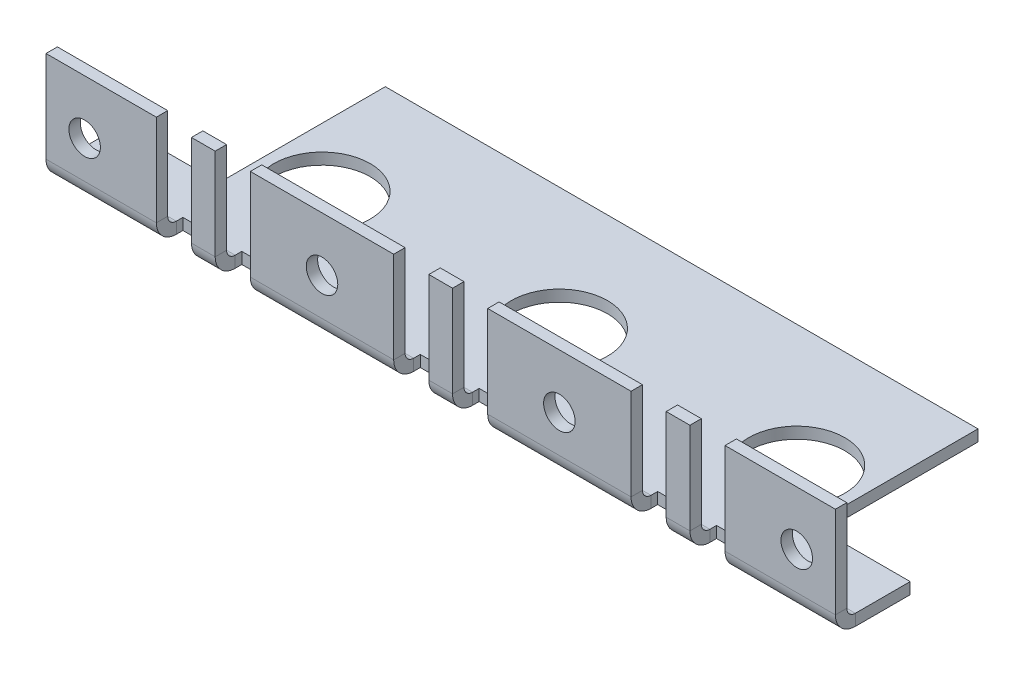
ISO-10303-21;
HEADER;
FILE_DESCRIPTION(('STEP AP214'),'2;1');
FILE_NAME('part.step','',(''),(''),'','','');
FILE_SCHEMA(('AUTOMOTIVE_DESIGN { 1 0 10303 214 1 1 1 1 }'));
ENDSEC;
DATA;
#1=APPLICATION_CONTEXT('core data for automotive mechanical design processes');
#2=APPLICATION_PROTOCOL_DEFINITION('international standard','automotive_design',2000,#1);
#3=PRODUCT_CONTEXT('',#1,'mechanical');
#4=PRODUCT('Part','Part','',(#3));
#5=PRODUCT_RELATED_PRODUCT_CATEGORY('part','',(#4));
#6=PRODUCT_DEFINITION_FORMATION('','',#4);
#7=PRODUCT_DEFINITION_CONTEXT('part definition',#1,'design');
#8=PRODUCT_DEFINITION('design','',#6,#7);
#9=PRODUCT_DEFINITION_SHAPE('','',#8);
#10=(LENGTH_UNIT() NAMED_UNIT(*) SI_UNIT(.MILLI.,.METRE.));
#11=(NAMED_UNIT(*) PLANE_ANGLE_UNIT() SI_UNIT($,.RADIAN.));
#12=(NAMED_UNIT(*) SI_UNIT($,.STERADIAN.) SOLID_ANGLE_UNIT());
#13=UNCERTAINTY_MEASURE_WITH_UNIT(LENGTH_MEASURE(1.E-05),#10,'distance_accuracy_value','');
#14=(GEOMETRIC_REPRESENTATION_CONTEXT(3) GLOBAL_UNCERTAINTY_ASSIGNED_CONTEXT((#13)) GLOBAL_UNIT_ASSIGNED_CONTEXT((#10,
#11,#12)) REPRESENTATION_CONTEXT('',''));
#15=CARTESIAN_POINT('',(0.,0.,0.));
#16=DIRECTION('',(0.,0.,1.));
#17=DIRECTION('',(1.,0.,0.));
#18=AXIS2_PLACEMENT_3D('',#15,#16,#17);
#19=CARTESIAN_POINT('',(33.3375,13.3858,-2.032));
#20=DIRECTION('',(-1.,0.,0.));
#21=DIRECTION('',(0.,-1.,0.));
#22=AXIS2_PLACEMENT_3D('',#19,#20,#21);
#23=PLANE('',#22);
#24=DIRECTION('',(0.,-1.,0.));
#25=VECTOR('',#24,1.);
#26=CARTESIAN_POINT('',(33.3375,13.3858,1.524));
#27=LINE('',#26,#25);
#28=CARTESIAN_POINT('',(33.3375,13.3858,1.524));
#29=VERTEX_POINT('',#28);
#30=CARTESIAN_POINT('',(33.3375,1.143,1.524));
#31=VERTEX_POINT('',#30);
#32=EDGE_CURVE('E445',#29,#31,#27,.T.);
#33=ORIENTED_EDGE('',*,*,#32,.T.);
#34=DIRECTION('',(0.,0.,-1.));
#35=VECTOR('',#34,1.);
#36=CARTESIAN_POINT('',(33.3375,1.143,1.524));
#37=LINE('',#36,#35);
#38=CARTESIAN_POINT('',(33.3375,1.143,0.));
#39=VERTEX_POINT('',#38);
#40=EDGE_CURVE('E11',#31,#39,#37,.T.);
#41=ORIENTED_EDGE('',*,*,#40,.T.);
#42=DIRECTION('',(0.,1.,0.));
#43=VECTOR('',#42,1.);
#44=CARTESIAN_POINT('',(33.3375,0.,0.));
#45=LINE('',#44,#43);
#46=CARTESIAN_POINT('',(33.3375,13.3858,0.));
#47=VERTEX_POINT('',#46);
#48=EDGE_CURVE('E454',#39,#47,#45,.T.);
#49=ORIENTED_EDGE('',*,*,#48,.T.);
#50=DIRECTION('',(0.,0.,1.));
#51=VECTOR('',#50,1.);
#52=CARTESIAN_POINT('',(33.3375,13.3858,-2.032));
#53=LINE('',#52,#51);
#54=EDGE_CURVE('E431',#47,#29,#53,.T.);
#55=ORIENTED_EDGE('',*,*,#54,.T.);
#56=EDGE_LOOP('',(#33,#41,#49,#55));
#57=FACE_BOUND('',#56,.T.);
#58=ADVANCED_FACE('F37',(#57),#23,.F.);
#59=DIRECTION('',(0.,0.,1.));
#60=VECTOR('',#59,1.);
#61=CARTESIAN_POINT('',(33.3375,0.,0.));
#62=LINE('',#61,#60);
#63=CARTESIAN_POINT('',(33.3375,0.,-2.032));
#64=VERTEX_POINT('',#63);
#65=CARTESIAN_POINT('',(33.3375,0.,-1.143));
#66=VERTEX_POINT('',#65);
#67=EDGE_CURVE('E878',#64,#66,#62,.T.);
#68=ORIENTED_EDGE('',*,*,#67,.T.);
#69=DIRECTION('',(0.,-1.,0.));
#70=VECTOR('',#69,1.);
#71=CARTESIAN_POINT('',(33.3375,0.,-1.143));
#72=LINE('',#71,#70);
#73=CARTESIAN_POINT('',(33.3375,-1.524,-1.143));
#74=VERTEX_POINT('',#73);
#75=EDGE_CURVE('E45',#66,#74,#72,.T.);
#76=ORIENTED_EDGE('',*,*,#75,.T.);
#77=DIRECTION('',(0.,0.,1.));
#78=VECTOR('',#77,1.);
#79=CARTESIAN_POINT('',(33.3375,-1.524,-2.032));
#80=LINE('',#79,#78);
#81=CARTESIAN_POINT('',(33.3375,-1.524,-2.032));
#82=VERTEX_POINT('',#81);
#83=EDGE_CURVE('E424',#82,#74,#80,.T.);
#84=ORIENTED_EDGE('',*,*,#83,.F.);
#85=DIRECTION('',(0.,-1.,0.));
#86=VECTOR('',#85,1.);
#87=CARTESIAN_POINT('',(33.3375,13.3858,-2.032));
#88=LINE('',#87,#86);
#89=EDGE_CURVE('E411',#64,#82,#88,.T.);
#90=ORIENTED_EDGE('',*,*,#89,.F.);
#91=EDGE_LOOP('',(#68,#76,#84,#90));
#92=FACE_BOUND('',#91,.T.);
#93=ADVANCED_FACE('F425',(#92),#23,.F.);
#94=CARTESIAN_POINT('',(38.0365,13.3858,-2.032));
#95=DIRECTION('',(1.,0.,0.));
#96=DIRECTION('',(0.,1.,0.));
#97=AXIS2_PLACEMENT_3D('',#94,#95,#96);
#98=PLANE('',#97);
#99=DIRECTION('',(0.,0.,1.));
#100=VECTOR('',#99,1.);
#101=CARTESIAN_POINT('',(38.0365,-1.524,-2.032));
#102=LINE('',#101,#100);
#103=CARTESIAN_POINT('',(38.0365,-1.524,-2.032));
#104=VERTEX_POINT('',#103);
#105=CARTESIAN_POINT('',(38.0365,-1.524,-1.143));
#106=VERTEX_POINT('',#105);
#107=EDGE_CURVE('E430',#104,#106,#102,.T.);
#108=ORIENTED_EDGE('',*,*,#107,.T.);
#109=DIRECTION('',(0.,1.,0.));
#110=VECTOR('',#109,1.);
#111=CARTESIAN_POINT('',(38.0365,-1.524,-1.143));
#112=LINE('',#111,#110);
#113=CARTESIAN_POINT('',(38.0365,0.,-1.143));
#114=VERTEX_POINT('',#113);
#115=EDGE_CURVE('E908',#106,#114,#112,.T.);
#116=ORIENTED_EDGE('',*,*,#115,.T.);
#117=DIRECTION('',(0.,0.,-1.));
#118=VECTOR('',#117,1.);
#119=CARTESIAN_POINT('',(38.0365,0.,0.));
#120=LINE('',#119,#118);
#121=CARTESIAN_POINT('',(38.0365,0.,-2.032));
#122=VERTEX_POINT('',#121);
#123=EDGE_CURVE('E880',#114,#122,#120,.T.);
#124=ORIENTED_EDGE('',*,*,#123,.T.);
#125=DIRECTION('',(0.,1.,0.));
#126=VECTOR('',#125,1.);
#127=CARTESIAN_POINT('',(38.0365,13.3858,-2.032));
#128=LINE('',#127,#126);
#129=EDGE_CURVE('E52',#104,#122,#128,.T.);
#130=ORIENTED_EDGE('',*,*,#129,.F.);
#131=EDGE_LOOP('',(#108,#116,#124,#130));
#132=FACE_BOUND('',#131,.T.);
#133=ADVANCED_FACE('F910',(#132),#98,.F.);
#134=DIRECTION('',(0.,-1.,0.));
#135=VECTOR('',#134,1.);
#136=CARTESIAN_POINT('',(38.0365,0.,0.));
#137=LINE('',#136,#135);
#138=CARTESIAN_POINT('',(38.0365,13.3858,0.));
#139=VERTEX_POINT('',#138);
#140=CARTESIAN_POINT('',(38.0365,1.143,0.));
#141=VERTEX_POINT('',#140);
#142=EDGE_CURVE('E462',#139,#141,#137,.T.);
#143=ORIENTED_EDGE('',*,*,#142,.T.);
#144=DIRECTION('',(0.,0.,1.));
#145=VECTOR('',#144,1.);
#146=CARTESIAN_POINT('',(38.0365,1.143,0.));
#147=LINE('',#146,#145);
#148=CARTESIAN_POINT('',(38.0365,1.143,1.524));
#149=VERTEX_POINT('',#148);
#150=EDGE_CURVE('E906',#141,#149,#147,.T.);
#151=ORIENTED_EDGE('',*,*,#150,.T.);
#152=DIRECTION('',(0.,1.,0.));
#153=VECTOR('',#152,1.);
#154=CARTESIAN_POINT('',(38.0365,13.3858,1.524));
#155=LINE('',#154,#153);
#156=CARTESIAN_POINT('',(38.0365,13.3858,1.524));
#157=VERTEX_POINT('',#156);
#158=EDGE_CURVE('E443',#149,#157,#155,.T.);
#159=ORIENTED_EDGE('',*,*,#158,.T.);
#160=DIRECTION('',(0.,0.,1.));
#161=VECTOR('',#160,1.);
#162=CARTESIAN_POINT('',(38.0365,13.3858,-2.032));
#163=LINE('',#162,#161);
#164=EDGE_CURVE('E437',#139,#157,#163,.T.);
#165=ORIENTED_EDGE('',*,*,#164,.F.);
#166=EDGE_LOOP('',(#143,#151,#159,#165));
#167=FACE_BOUND('',#166,.T.);
#168=ADVANCED_FACE('F1266',(#167),#98,.F.);
#169=CARTESIAN_POINT('',(30.1625,13.3858,-2.032));
#170=DIRECTION('',(1.,0.,0.));
#171=DIRECTION('',(0.,1.,0.));
#172=AXIS2_PLACEMENT_3D('',#169,#170,#171);
#173=PLANE('',#172);
#174=DIRECTION('',(0.,0.,1.));
#175=VECTOR('',#174,1.);
#176=CARTESIAN_POINT('',(30.1625,-1.524,-2.032));
#177=LINE('',#176,#175);
#178=CARTESIAN_POINT('',(30.1625,-1.524,-2.032));
#179=VERTEX_POINT('',#178);
#180=CARTESIAN_POINT('',(30.1625,-1.524,-1.143));
#181=VERTEX_POINT('',#180);
#182=EDGE_CURVE('E486',#179,#181,#177,.T.);
#183=ORIENTED_EDGE('',*,*,#182,.T.);
#184=DIRECTION('',(0.,1.,0.));
#185=VECTOR('',#184,1.);
#186=CARTESIAN_POINT('',(30.1625,-1.524,-1.143));
#187=LINE('',#186,#185);
#188=CARTESIAN_POINT('',(30.1625,0.,-1.143));
#189=VERTEX_POINT('',#188);
#190=EDGE_CURVE('E904',#181,#189,#187,.T.);
#191=ORIENTED_EDGE('',*,*,#190,.T.);
#192=DIRECTION('',(0.,0.,-1.));
#193=VECTOR('',#192,1.);
#194=CARTESIAN_POINT('',(30.1625,0.,0.));
#195=LINE('',#194,#193);
#196=CARTESIAN_POINT('',(30.1625,0.,-2.032));
#197=VERTEX_POINT('',#196);
#198=EDGE_CURVE('E872',#189,#197,#195,.T.);
#199=ORIENTED_EDGE('',*,*,#198,.T.);
#200=DIRECTION('',(0.,1.,0.));
#201=VECTOR('',#200,1.);
#202=CARTESIAN_POINT('',(30.1625,13.3858,-2.032));
#203=LINE('',#202,#201);
#204=EDGE_CURVE('E60',#179,#197,#203,.T.);
#205=ORIENTED_EDGE('',*,*,#204,.F.);
#206=EDGE_LOOP('',(#183,#191,#199,#205));
#207=FACE_BOUND('',#206,.T.);
#208=ADVANCED_FACE('F1063',(#207),#173,.F.);
#209=DIRECTION('',(0.,-1.,0.));
#210=VECTOR('',#209,1.);
#211=CARTESIAN_POINT('',(30.1625,0.,0.));
#212=LINE('',#211,#210);
#213=CARTESIAN_POINT('',(30.1625,13.3858,0.));
#214=VERTEX_POINT('',#213);
#215=CARTESIAN_POINT('',(30.1625,1.143,0.));
#216=VERTEX_POINT('',#215);
#217=EDGE_CURVE('E493',#214,#216,#212,.T.);
#218=ORIENTED_EDGE('',*,*,#217,.T.);
#219=DIRECTION('',(0.,0.,1.));
#220=VECTOR('',#219,1.);
#221=CARTESIAN_POINT('',(30.1625,1.143,0.));
#222=LINE('',#221,#220);
#223=CARTESIAN_POINT('',(30.1625,1.143,1.524));
#224=VERTEX_POINT('',#223);
#225=EDGE_CURVE('E902',#216,#224,#222,.T.);
#226=ORIENTED_EDGE('',*,*,#225,.T.);
#227=DIRECTION('',(0.,1.,0.));
#228=VECTOR('',#227,1.);
#229=CARTESIAN_POINT('',(30.1625,13.3858,1.524));
#230=LINE('',#229,#228);
#231=CARTESIAN_POINT('',(30.1625,13.3858,1.524));
#232=VERTEX_POINT('',#231);
#233=EDGE_CURVE('E472',#224,#232,#230,.T.);
#234=ORIENTED_EDGE('',*,*,#233,.T.);
#235=DIRECTION('',(0.,0.,1.));
#236=VECTOR('',#235,1.);
#237=CARTESIAN_POINT('',(30.1625,13.3858,-2.032));
#238=LINE('',#237,#236);
#239=EDGE_CURVE('E483',#214,#232,#238,.T.);
#240=ORIENTED_EDGE('',*,*,#239,.F.);
#241=EDGE_LOOP('',(#218,#226,#234,#240));
#242=FACE_BOUND('',#241,.T.);
#243=ADVANCED_FACE('F1052',(#242),#173,.F.);
#244=CARTESIAN_POINT('',(25.4635,13.3858,-2.032));
#245=DIRECTION('',(-1.,0.,0.));
#246=DIRECTION('',(0.,-1.,0.));
#247=AXIS2_PLACEMENT_3D('',#244,#245,#246);
#248=PLANE('',#247);
#249=DIRECTION('',(0.,-1.,0.));
#250=VECTOR('',#249,1.);
#251=CARTESIAN_POINT('',(25.4635,13.3858,1.524));
#252=LINE('',#251,#250);
#253=CARTESIAN_POINT('',(25.4635,13.3858,1.524));
#254=VERTEX_POINT('',#253);
#255=CARTESIAN_POINT('',(25.4635,1.143,1.524));
#256=VERTEX_POINT('',#255);
#257=EDGE_CURVE('E468',#254,#256,#252,.T.);
#258=ORIENTED_EDGE('',*,*,#257,.T.);
#259=DIRECTION('',(0.,0.,-1.));
#260=VECTOR('',#259,1.);
#261=CARTESIAN_POINT('',(25.4635,1.143,1.524));
#262=LINE('',#261,#260);
#263=CARTESIAN_POINT('',(25.4635,1.143,0.));
#264=VERTEX_POINT('',#263);
#265=EDGE_CURVE('E900',#256,#264,#262,.T.);
#266=ORIENTED_EDGE('',*,*,#265,.T.);
#267=DIRECTION('',(0.,1.,0.));
#268=VECTOR('',#267,1.);
#269=CARTESIAN_POINT('',(25.4635,0.,0.));
#270=LINE('',#269,#268);
#271=CARTESIAN_POINT('',(25.4635,13.3858,0.));
#272=VERTEX_POINT('',#271);
#273=EDGE_CURVE('E502',#264,#272,#270,.T.);
#274=ORIENTED_EDGE('',*,*,#273,.T.);
#275=DIRECTION('',(0.,0.,1.));
#276=VECTOR('',#275,1.);
#277=CARTESIAN_POINT('',(25.4635,13.3858,-2.032));
#278=LINE('',#277,#276);
#279=EDGE_CURVE('E480',#272,#254,#278,.T.);
#280=ORIENTED_EDGE('',*,*,#279,.T.);
#281=EDGE_LOOP('',(#258,#266,#274,#280));
#282=FACE_BOUND('',#281,.T.);
#283=ADVANCED_FACE('F1281',(#282),#248,.F.);
#284=DIRECTION('',(0.,0.,1.));
#285=VECTOR('',#284,1.);
#286=CARTESIAN_POINT('',(25.4635,0.,0.));
#287=LINE('',#286,#285);
#288=CARTESIAN_POINT('',(25.4635,0.,-2.032));
#289=VERTEX_POINT('',#288);
#290=CARTESIAN_POINT('',(25.4635,0.,-1.143));
#291=VERTEX_POINT('',#290);
#292=EDGE_CURVE('E874',#289,#291,#287,.T.);
#293=ORIENTED_EDGE('',*,*,#292,.T.);
#294=DIRECTION('',(0.,-1.,0.));
#295=VECTOR('',#294,1.);
#296=CARTESIAN_POINT('',(25.4635,0.,-1.143));
#297=LINE('',#296,#295);
#298=CARTESIAN_POINT('',(25.4635,-1.524,-1.143));
#299=VERTEX_POINT('',#298);
#300=EDGE_CURVE('E898',#291,#299,#297,.T.);
#301=ORIENTED_EDGE('',*,*,#300,.T.);
#302=DIRECTION('',(0.,0.,1.));
#303=VECTOR('',#302,1.);
#304=CARTESIAN_POINT('',(25.4635,-1.524,-2.032));
#305=LINE('',#304,#303);
#306=CARTESIAN_POINT('',(25.4635,-1.524,-2.032));
#307=VERTEX_POINT('',#306);
#308=EDGE_CURVE('E475',#307,#299,#305,.T.);
#309=ORIENTED_EDGE('',*,*,#308,.F.);
#310=DIRECTION('',(0.,-1.,0.));
#311=VECTOR('',#310,1.);
#312=CARTESIAN_POINT('',(25.4635,13.3858,-2.032));
#313=LINE('',#312,#311);
#314=EDGE_CURVE('E469',#289,#307,#313,.T.);
#315=ORIENTED_EDGE('',*,*,#314,.F.);
#316=EDGE_LOOP('',(#293,#301,#309,#315));
#317=FACE_BOUND('',#316,.T.);
#318=ADVANCED_FACE('F1290',(#317),#248,.F.);
#319=CARTESIAN_POINT('',(-30.1625,13.3858,-2.032));
#320=DIRECTION('',(-1.,0.,0.));
#321=DIRECTION('',(0.,-1.,0.));
#322=AXIS2_PLACEMENT_3D('',#319,#320,#321);
#323=PLANE('',#322);
#324=DIRECTION('',(0.,-1.,0.));
#325=VECTOR('',#324,1.);
#326=CARTESIAN_POINT('',(-30.1625,13.3858,1.524));
#327=LINE('',#326,#325);
#328=CARTESIAN_POINT('',(-30.1625,13.3858,1.524));
#329=VERTEX_POINT('',#328);
#330=CARTESIAN_POINT('',(-30.1625,1.143,1.524));
#331=VERTEX_POINT('',#330);
#332=EDGE_CURVE('E511',#329,#331,#327,.T.);
#333=ORIENTED_EDGE('',*,*,#332,.T.);
#334=DIRECTION('',(0.,0.,-1.));
#335=VECTOR('',#334,1.);
#336=CARTESIAN_POINT('',(-30.1625,1.143,1.524));
#337=LINE('',#336,#335);
#338=CARTESIAN_POINT('',(-30.1625,1.143,0.));
#339=VERTEX_POINT('',#338);
#340=EDGE_CURVE('E896',#331,#339,#337,.T.);
#341=ORIENTED_EDGE('',*,*,#340,.T.);
#342=DIRECTION('',(0.,1.,0.));
#343=VECTOR('',#342,1.);
#344=CARTESIAN_POINT('',(-30.1625,0.,0.));
#345=LINE('',#344,#343);
#346=CARTESIAN_POINT('',(-30.1625,13.3858,0.));
#347=VERTEX_POINT('',#346);
#348=EDGE_CURVE('E533',#339,#347,#345,.T.);
#349=ORIENTED_EDGE('',*,*,#348,.T.);
#350=DIRECTION('',(0.,0.,1.));
#351=VECTOR('',#350,1.);
#352=CARTESIAN_POINT('',(-30.1625,13.3858,-2.032));
#353=LINE('',#352,#351);
#354=EDGE_CURVE('E527',#347,#329,#353,.T.);
#355=ORIENTED_EDGE('',*,*,#354,.T.);
#356=EDGE_LOOP('',(#333,#341,#349,#355));
#357=FACE_BOUND('',#356,.T.);
#358=ADVANCED_FACE('F1300',(#357),#323,.F.);
#359=DIRECTION('',(0.,0.,1.));
#360=VECTOR('',#359,1.);
#361=CARTESIAN_POINT('',(-30.1625,0.,0.));
#362=LINE('',#361,#360);
#363=CARTESIAN_POINT('',(-30.1625,0.,-2.032));
#364=VERTEX_POINT('',#363);
#365=CARTESIAN_POINT('',(-30.1625,0.,-1.143));
#366=VERTEX_POINT('',#365);
#367=EDGE_CURVE('E863',#364,#366,#362,.T.);
#368=ORIENTED_EDGE('',*,*,#367,.T.);
#369=DIRECTION('',(0.,-1.,0.));
#370=VECTOR('',#369,1.);
#371=CARTESIAN_POINT('',(-30.1625,0.,-1.143));
#372=LINE('',#371,#370);
#373=CARTESIAN_POINT('',(-30.1625,-1.524,-1.143));
#374=VERTEX_POINT('',#373);
#375=EDGE_CURVE('E894',#366,#374,#372,.T.);
#376=ORIENTED_EDGE('',*,*,#375,.T.);
#377=DIRECTION('',(0.,0.,1.));
#378=VECTOR('',#377,1.);
#379=CARTESIAN_POINT('',(-30.1625,-1.524,-2.032));
#380=LINE('',#379,#378);
#381=CARTESIAN_POINT('',(-30.1625,-1.524,-2.032));
#382=VERTEX_POINT('',#381);
#383=EDGE_CURVE('E524',#382,#374,#380,.T.);
#384=ORIENTED_EDGE('',*,*,#383,.F.);
#385=DIRECTION('',(0.,-1.,0.));
#386=VECTOR('',#385,1.);
#387=CARTESIAN_POINT('',(-30.1625,13.3858,-2.032));
#388=LINE('',#387,#386);
#389=EDGE_CURVE('E510',#364,#382,#388,.T.);
#390=ORIENTED_EDGE('',*,*,#389,.F.);
#391=EDGE_LOOP('',(#368,#376,#384,#390));
#392=FACE_BOUND('',#391,.T.);
#393=ADVANCED_FACE('F1305',(#392),#323,.F.);
#394=CARTESIAN_POINT('',(-25.4635,13.3858,-2.032));
#395=DIRECTION('',(1.,0.,0.));
#396=DIRECTION('',(0.,1.,0.));
#397=AXIS2_PLACEMENT_3D('',#394,#395,#396);
#398=PLANE('',#397);
#399=DIRECTION('',(0.,0.,1.));
#400=VECTOR('',#399,1.);
#401=CARTESIAN_POINT('',(-25.4635,-1.524,-2.032));
#402=LINE('',#401,#400);
#403=CARTESIAN_POINT('',(-25.4635,-1.524,-2.032));
#404=VERTEX_POINT('',#403);
#405=CARTESIAN_POINT('',(-25.4635,-1.524,-1.143));
#406=VERTEX_POINT('',#405);
#407=EDGE_CURVE('E520',#404,#406,#402,.T.);
#408=ORIENTED_EDGE('',*,*,#407,.T.);
#409=DIRECTION('',(0.,1.,0.));
#410=VECTOR('',#409,1.);
#411=CARTESIAN_POINT('',(-25.4635,-1.524,-1.143));
#412=LINE('',#411,#410);
#413=CARTESIAN_POINT('',(-25.4635,0.,-1.143));
#414=VERTEX_POINT('',#413);
#415=EDGE_CURVE('E892',#406,#414,#412,.T.);
#416=ORIENTED_EDGE('',*,*,#415,.T.);
#417=DIRECTION('',(0.,0.,-1.));
#418=VECTOR('',#417,1.);
#419=CARTESIAN_POINT('',(-25.4635,0.,0.));
#420=LINE('',#419,#418);
#421=CARTESIAN_POINT('',(-25.4635,0.,-2.032));
#422=VERTEX_POINT('',#421);
#423=EDGE_CURVE('E866',#414,#422,#420,.T.);
#424=ORIENTED_EDGE('',*,*,#423,.T.);
#425=DIRECTION('',(0.,1.,0.));
#426=VECTOR('',#425,1.);
#427=CARTESIAN_POINT('',(-25.4635,13.3858,-2.032));
#428=LINE('',#427,#426);
#429=EDGE_CURVE('E508',#404,#422,#428,.T.);
#430=ORIENTED_EDGE('',*,*,#429,.F.);
#431=EDGE_LOOP('',(#408,#416,#424,#430));
#432=FACE_BOUND('',#431,.T.);
#433=ADVANCED_FACE('F1115',(#432),#398,.F.);
#434=DIRECTION('',(0.,-1.,0.));
#435=VECTOR('',#434,1.);
#436=CARTESIAN_POINT('',(-25.4635,0.,0.));
#437=LINE('',#436,#435);
#438=CARTESIAN_POINT('',(-25.4635,13.3858,0.));
#439=VERTEX_POINT('',#438);
#440=CARTESIAN_POINT('',(-25.4635,1.143,0.));
#441=VERTEX_POINT('',#440);
#442=EDGE_CURVE('E541',#439,#441,#437,.T.);
#443=ORIENTED_EDGE('',*,*,#442,.T.);
#444=DIRECTION('',(0.,0.,1.));
#445=VECTOR('',#444,1.);
#446=CARTESIAN_POINT('',(-25.4635,1.143,0.));
#447=LINE('',#446,#445);
#448=CARTESIAN_POINT('',(-25.4635,1.143,1.524));
#449=VERTEX_POINT('',#448);
#450=EDGE_CURVE('E890',#441,#449,#447,.T.);
#451=ORIENTED_EDGE('',*,*,#450,.T.);
#452=DIRECTION('',(0.,1.,0.));
#453=VECTOR('',#452,1.);
#454=CARTESIAN_POINT('',(-25.4635,13.3858,1.524));
#455=LINE('',#454,#453);
#456=CARTESIAN_POINT('',(-25.4635,13.3858,1.524));
#457=VERTEX_POINT('',#456);
#458=EDGE_CURVE('E507',#449,#457,#455,.T.);
#459=ORIENTED_EDGE('',*,*,#458,.T.);
#460=DIRECTION('',(0.,0.,1.));
#461=VECTOR('',#460,1.);
#462=CARTESIAN_POINT('',(-25.4635,13.3858,-2.032));
#463=LINE('',#462,#461);
#464=EDGE_CURVE('E516',#439,#457,#463,.T.);
#465=ORIENTED_EDGE('',*,*,#464,.F.);
#466=EDGE_LOOP('',(#443,#451,#459,#465));
#467=FACE_BOUND('',#466,.T.);
#468=ADVANCED_FACE('F1017',(#467),#398,.F.);
#469=CARTESIAN_POINT('',(-33.3375,13.3858,-2.032));
#470=DIRECTION('',(1.,0.,0.));
#471=DIRECTION('',(0.,1.,0.));
#472=AXIS2_PLACEMENT_3D('',#469,#470,#471);
#473=PLANE('',#472);
#474=DIRECTION('',(0.,0.,1.));
#475=VECTOR('',#474,1.);
#476=CARTESIAN_POINT('',(-33.3375,-1.524,-2.032));
#477=LINE('',#476,#475);
#478=CARTESIAN_POINT('',(-33.3375,-1.524,-2.032));
#479=VERTEX_POINT('',#478);
#480=CARTESIAN_POINT('',(-33.3375,-1.524,-1.143));
#481=VERTEX_POINT('',#480);
#482=EDGE_CURVE('E567',#479,#481,#477,.T.);
#483=ORIENTED_EDGE('',*,*,#482,.T.);
#484=DIRECTION('',(0.,1.,0.));
#485=VECTOR('',#484,1.);
#486=CARTESIAN_POINT('',(-33.3375,-1.524,-1.143));
#487=LINE('',#486,#485);
#488=CARTESIAN_POINT('',(-33.3375,0.,-1.143));
#489=VERTEX_POINT('',#488);
#490=EDGE_CURVE('E888',#481,#489,#487,.T.);
#491=ORIENTED_EDGE('',*,*,#490,.T.);
#492=DIRECTION('',(0.,0.,-1.));
#493=VECTOR('',#492,1.);
#494=CARTESIAN_POINT('',(-33.3375,0.,0.));
#495=LINE('',#494,#493);
#496=CARTESIAN_POINT('',(-33.3375,0.,-2.032));
#497=VERTEX_POINT('',#496);
#498=EDGE_CURVE('E855',#489,#497,#495,.T.);
#499=ORIENTED_EDGE('',*,*,#498,.T.);
#500=DIRECTION('',(0.,1.,0.));
#501=VECTOR('',#500,1.);
#502=CARTESIAN_POINT('',(-33.3375,13.3858,-2.032));
#503=LINE('',#502,#501);
#504=EDGE_CURVE('E554',#479,#497,#503,.T.);
#505=ORIENTED_EDGE('',*,*,#504,.F.);
#506=EDGE_LOOP('',(#483,#491,#499,#505));
#507=FACE_BOUND('',#506,.T.);
#508=ADVANCED_FACE('F1227',(#507),#473,.F.);
#509=DIRECTION('',(0.,-1.,0.));
#510=VECTOR('',#509,1.);
#511=CARTESIAN_POINT('',(-33.3375,0.,0.));
#512=LINE('',#511,#510);
#513=CARTESIAN_POINT('',(-33.3375,13.3858,0.));
#514=VERTEX_POINT('',#513);
#515=CARTESIAN_POINT('',(-33.3375,1.143,0.));
#516=VERTEX_POINT('',#515);
#517=EDGE_CURVE('E574',#514,#516,#512,.T.);
#518=ORIENTED_EDGE('',*,*,#517,.T.);
#519=DIRECTION('',(0.,0.,1.));
#520=VECTOR('',#519,1.);
#521=CARTESIAN_POINT('',(-33.3375,1.143,0.));
#522=LINE('',#521,#520);
#523=CARTESIAN_POINT('',(-33.3375,1.143,1.524));
#524=VERTEX_POINT('',#523);
#525=EDGE_CURVE('E886',#516,#524,#522,.T.);
#526=ORIENTED_EDGE('',*,*,#525,.T.);
#527=DIRECTION('',(0.,1.,0.));
#528=VECTOR('',#527,1.);
#529=CARTESIAN_POINT('',(-33.3375,13.3858,1.524));
#530=LINE('',#529,#528);
#531=CARTESIAN_POINT('',(-33.3375,13.3858,1.524));
#532=VERTEX_POINT('',#531);
#533=EDGE_CURVE('E551',#524,#532,#530,.T.);
#534=ORIENTED_EDGE('',*,*,#533,.T.);
#535=DIRECTION('',(0.,0.,1.));
#536=VECTOR('',#535,1.);
#537=CARTESIAN_POINT('',(-33.3375,13.3858,-2.032));
#538=LINE('',#537,#536);
#539=EDGE_CURVE('E564',#514,#532,#538,.T.);
#540=ORIENTED_EDGE('',*,*,#539,.F.);
#541=EDGE_LOOP('',(#518,#526,#534,#540));
#542=FACE_BOUND('',#541,.T.);
#543=ADVANCED_FACE('F1216',(#542),#473,.F.);
#544=CARTESIAN_POINT('',(-38.0365,13.3858,-2.032));
#545=DIRECTION('',(-1.,0.,0.));
#546=DIRECTION('',(0.,-1.,0.));
#547=AXIS2_PLACEMENT_3D('',#544,#545,#546);
#548=PLANE('',#547);
#549=DIRECTION('',(0.,-1.,0.));
#550=VECTOR('',#549,1.);
#551=CARTESIAN_POINT('',(-38.0365,13.3858,1.524));
#552=LINE('',#551,#550);
#553=CARTESIAN_POINT('',(-38.0365,13.3858,1.524));
#554=VERTEX_POINT('',#553);
#555=CARTESIAN_POINT('',(-38.0365,1.143,1.524));
#556=VERTEX_POINT('',#555);
#557=EDGE_CURVE('E547',#554,#556,#552,.T.);
#558=ORIENTED_EDGE('',*,*,#557,.T.);
#559=DIRECTION('',(0.,0.,-1.));
#560=VECTOR('',#559,1.);
#561=CARTESIAN_POINT('',(-38.0365,1.143,1.524));
#562=LINE('',#561,#560);
#563=CARTESIAN_POINT('',(-38.0365,1.143,0.));
#564=VERTEX_POINT('',#563);
#565=EDGE_CURVE('E884',#556,#564,#562,.T.);
#566=ORIENTED_EDGE('',*,*,#565,.T.);
#567=DIRECTION('',(0.,1.,0.));
#568=VECTOR('',#567,1.);
#569=CARTESIAN_POINT('',(-38.0365,0.,0.));
#570=LINE('',#569,#568);
#571=CARTESIAN_POINT('',(-38.0365,13.3858,0.));
#572=VERTEX_POINT('',#571);
#573=EDGE_CURVE('E583',#564,#572,#570,.T.);
#574=ORIENTED_EDGE('',*,*,#573,.T.);
#575=DIRECTION('',(0.,0.,1.));
#576=VECTOR('',#575,1.);
#577=CARTESIAN_POINT('',(-38.0365,13.3858,-2.032));
#578=LINE('',#577,#576);
#579=EDGE_CURVE('E561',#572,#554,#578,.T.);
#580=ORIENTED_EDGE('',*,*,#579,.T.);
#581=EDGE_LOOP('',(#558,#566,#574,#580));
#582=FACE_BOUND('',#581,.T.);
#583=ADVANCED_FACE('F1238',(#582),#548,.F.);
#584=DIRECTION('',(0.,0.,1.));
#585=VECTOR('',#584,1.);
#586=CARTESIAN_POINT('',(-38.0365,0.,0.));
#587=LINE('',#586,#585);
#588=CARTESIAN_POINT('',(-38.0365,0.,-2.032));
#589=VERTEX_POINT('',#588);
#590=CARTESIAN_POINT('',(-38.0365,0.,-1.143));
#591=VERTEX_POINT('',#590);
#592=EDGE_CURVE('E858',#589,#591,#587,.T.);
#593=ORIENTED_EDGE('',*,*,#592,.T.);
#594=DIRECTION('',(0.,-1.,0.));
#595=VECTOR('',#594,1.);
#596=CARTESIAN_POINT('',(-38.0365,0.,-1.143));
#597=LINE('',#596,#595);
#598=CARTESIAN_POINT('',(-38.0365,-1.524,-1.143));
#599=VERTEX_POINT('',#598);
#600=EDGE_CURVE('E882',#591,#599,#597,.T.);
#601=ORIENTED_EDGE('',*,*,#600,.T.);
#602=DIRECTION('',(0.,0.,1.));
#603=VECTOR('',#602,1.);
#604=CARTESIAN_POINT('',(-38.0365,-1.524,-2.032));
#605=LINE('',#604,#603);
#606=CARTESIAN_POINT('',(-38.0365,-1.524,-2.032));
#607=VERTEX_POINT('',#606);
#608=EDGE_CURVE('E556',#607,#599,#605,.T.);
#609=ORIENTED_EDGE('',*,*,#608,.F.);
#610=DIRECTION('',(0.,-1.,0.));
#611=VECTOR('',#610,1.);
#612=CARTESIAN_POINT('',(-38.0365,13.3858,-2.032));
#613=LINE('',#612,#611);
#614=EDGE_CURVE('E548',#589,#607,#613,.T.);
#615=ORIENTED_EDGE('',*,*,#614,.F.);
#616=EDGE_LOOP('',(#593,#601,#609,#615));
#617=FACE_BOUND('',#616,.T.);
#618=ADVANCED_FACE('F1234',(#617),#548,.F.);
#619=CARTESIAN_POINT('',(52.7939,1.143,-1.143));
#620=DIRECTION('',(-1.,0.,0.));
#621=DIRECTION('',(0.,0.,1.));
#622=AXIS2_PLACEMENT_3D('',#619,#620,#621);
#623=CYLINDRICAL_SURFACE('',#622,1.143);
#624=CARTESIAN_POINT('',(38.0365,1.143,-1.143));
#625=DIRECTION('',(1.,0.,0.));
#626=DIRECTION('',(0.,1.,0.));
#627=AXIS2_PLACEMENT_3D('',#624,#625,#626);
#628=CIRCLE('',#627,1.143);
#629=EDGE_CURVE('E459',#141,#114,#628,.T.);
#630=ORIENTED_EDGE('',*,*,#629,.F.);
#631=DIRECTION('',(-1.,0.,0.));
#632=VECTOR('',#631,1.);
#633=CARTESIAN_POINT('',(52.7939,1.143,0.));
#634=LINE('',#633,#632);
#635=CARTESIAN_POINT('',(52.7939,1.143,0.));
#636=VERTEX_POINT('',#635);
#637=EDGE_CURVE('E790',#636,#141,#634,.T.);
#638=ORIENTED_EDGE('',*,*,#637,.F.);
#639=CARTESIAN_POINT('',(52.7939,1.143,-1.143));
#640=DIRECTION('',(-1.,0.,0.));
#641=DIRECTION('',(0.,0.,1.));
#642=AXIS2_PLACEMENT_3D('',#639,#640,#641);
#643=CIRCLE('',#642,1.143);
#644=CARTESIAN_POINT('',(52.7939,0.,-1.143));
#645=VERTEX_POINT('',#644);
#646=EDGE_CURVE('E732',#636,#645,#643,.F.);
#647=ORIENTED_EDGE('',*,*,#646,.T.);
#648=DIRECTION('',(-1.,0.,0.));
#649=VECTOR('',#648,1.);
#650=CARTESIAN_POINT('',(52.7939,0.,-1.143));
#651=LINE('',#650,#649);
#652=EDGE_CURVE('E796',#645,#114,#651,.T.);
#653=ORIENTED_EDGE('',*,*,#652,.T.);
#654=EDGE_LOOP('',(#630,#638,#647,#653));
#655=FACE_BOUND('',#654,.T.);
#656=ADVANCED_FACE('F923',(#655),#623,.F.);
#657=CARTESIAN_POINT('',(52.7939,0.,0.));
#658=DIRECTION('',(0.,0.,-1.));
#659=DIRECTION('',(-1.,0.,0.));
#660=AXIS2_PLACEMENT_3D('',#657,#658,#659);
#661=PLANE('',#660);
#662=CARTESIAN_POINT('',(47.625,6.1468,0.));
#663=DIRECTION('',(0.,0.,1.));
#664=DIRECTION('',(-1.,0.,0.));
#665=AXIS2_PLACEMENT_3D('',#662,#663,#664);
#666=CIRCLE('',#665,2.1082);
#667=CARTESIAN_POINT('',(49.7332,6.1468,0.));
#668=VERTEX_POINT('',#667);
#669=EDGE_CURVE('E2234',#668,#668,#666,.T.);
#670=ORIENTED_EDGE('',*,*,#669,.T.);
#671=EDGE_LOOP('',(#670));
#672=FACE_BOUND('',#671,.T.);
#673=ORIENTED_EDGE('',*,*,#142,.F.);
#674=DIRECTION('',(-1.,0.,0.));
#675=VECTOR('',#674,1.);
#676=CARTESIAN_POINT('',(52.7939,13.3858,0.));
#677=LINE('',#676,#675);
#678=CARTESIAN_POINT('',(52.7939,13.3858,0.));
#679=VERTEX_POINT('',#678);
#680=EDGE_CURVE('E784',#679,#139,#677,.T.);
#681=ORIENTED_EDGE('',*,*,#680,.F.);
#682=DIRECTION('',(0.,-1.,0.));
#683=VECTOR('',#682,1.);
#684=CARTESIAN_POINT('',(52.7939,0.,0.));
#685=LINE('',#684,#683);
#686=EDGE_CURVE('E735',#679,#636,#685,.T.);
#687=ORIENTED_EDGE('',*,*,#686,.T.);
#688=ORIENTED_EDGE('',*,*,#637,.T.);
#689=EDGE_LOOP('',(#673,#681,#687,#688));
#690=FACE_BOUND('',#689,.T.);
#691=ADVANCED_FACE('F929',(#672,#690),#661,.T.);
#692=CARTESIAN_POINT('',(52.7939,13.3858,1.524));
#693=DIRECTION('',(0.,1.,0.));
#694=DIRECTION('',(0.,0.,1.));
#695=AXIS2_PLACEMENT_3D('',#692,#693,#694);
#696=PLANE('',#695);
#697=ORIENTED_EDGE('',*,*,#164,.T.);
#698=DIRECTION('',(-1.,0.,0.));
#699=VECTOR('',#698,1.);
#700=CARTESIAN_POINT('',(52.7939,13.3858,1.524));
#701=LINE('',#700,#699);
#702=CARTESIAN_POINT('',(52.7939,13.3858,1.524));
#703=VERTEX_POINT('',#702);
#704=EDGE_CURVE('E778',#703,#157,#701,.T.);
#705=ORIENTED_EDGE('',*,*,#704,.F.);
#706=DIRECTION('',(0.,0.,-1.));
#707=VECTOR('',#706,1.);
#708=CARTESIAN_POINT('',(52.7939,13.3858,1.524));
#709=LINE('',#708,#707);
#710=EDGE_CURVE('E738',#703,#679,#709,.T.);
#711=ORIENTED_EDGE('',*,*,#710,.T.);
#712=ORIENTED_EDGE('',*,*,#680,.T.);
#713=EDGE_LOOP('',(#697,#705,#711,#712));
#714=FACE_BOUND('',#713,.T.);
#715=ADVANCED_FACE('F934',(#714),#696,.T.);
#716=CARTESIAN_POINT('',(52.7939,0.,1.524));
#717=DIRECTION('',(0.,0.,-1.));
#718=DIRECTION('',(-1.,0.,0.));
#719=AXIS2_PLACEMENT_3D('',#716,#717,#718);
#720=PLANE('',#719);
#721=CARTESIAN_POINT('',(47.625,6.1468,1.524));
#722=DIRECTION('',(0.,0.,1.));
#723=DIRECTION('',(-1.,0.,0.));
#724=AXIS2_PLACEMENT_3D('',#721,#722,#723);
#725=CIRCLE('',#724,2.1082);
#726=CARTESIAN_POINT('',(49.7332,6.1468,1.524));
#727=VERTEX_POINT('',#726);
#728=EDGE_CURVE('E2236',#727,#727,#725,.T.);
#729=ORIENTED_EDGE('',*,*,#728,.F.);
#730=EDGE_LOOP('',(#729));
#731=FACE_BOUND('',#730,.T.);
#732=ORIENTED_EDGE('',*,*,#704,.T.);
#733=ORIENTED_EDGE('',*,*,#158,.F.);
#734=DIRECTION('',(-1.,0.,0.));
#735=VECTOR('',#734,1.);
#736=CARTESIAN_POINT('',(52.7939,1.143,1.524));
#737=LINE('',#736,#735);
#738=CARTESIAN_POINT('',(52.7939,1.143,1.524));
#739=VERTEX_POINT('',#738);
#740=EDGE_CURVE('E772',#739,#149,#737,.T.);
#741=ORIENTED_EDGE('',*,*,#740,.F.);
#742=DIRECTION('',(0.,1.,0.));
#743=VECTOR('',#742,1.);
#744=CARTESIAN_POINT('',(52.7939,0.,1.524));
#745=LINE('',#744,#743);
#746=EDGE_CURVE('E741',#703,#739,#745,.F.);
#747=ORIENTED_EDGE('',*,*,#746,.F.);
#748=EDGE_LOOP('',(#732,#733,#741,#747));
#749=FACE_BOUND('',#748,.T.);
#750=ADVANCED_FACE('F939',(#731,#749),#720,.F.);
#751=CARTESIAN_POINT('',(52.7939,1.143,-1.143));
#752=DIRECTION('',(-1.,0.,0.));
#753=DIRECTION('',(0.,0.,1.));
#754=AXIS2_PLACEMENT_3D('',#751,#752,#753);
#755=CYLINDRICAL_SURFACE('',#754,2.667);
#756=ORIENTED_EDGE('',*,*,#740,.T.);
#757=CARTESIAN_POINT('',(38.0365,1.143,-1.143));
#758=DIRECTION('',(1.,0.,0.));
#759=DIRECTION('',(0.,1.,0.));
#760=AXIS2_PLACEMENT_3D('',#757,#758,#759);
#761=CIRCLE('',#760,2.667);
#762=EDGE_CURVE('E465',#149,#106,#761,.T.);
#763=ORIENTED_EDGE('',*,*,#762,.T.);
#764=DIRECTION('',(-1.,0.,0.));
#765=VECTOR('',#764,1.);
#766=CARTESIAN_POINT('',(52.7939,-1.524,-1.143));
#767=LINE('',#766,#765);
#768=CARTESIAN_POINT('',(52.7939,-1.524,-1.143));
#769=VERTEX_POINT('',#768);
#770=EDGE_CURVE('E767',#769,#106,#767,.T.);
#771=ORIENTED_EDGE('',*,*,#770,.F.);
#772=CARTESIAN_POINT('',(52.7939,1.143,-1.143));
#773=DIRECTION('',(1.,0.,0.));
#774=DIRECTION('',(0.,0.,-1.));
#775=AXIS2_PLACEMENT_3D('',#772,#773,#774);
#776=CIRCLE('',#775,2.667);
#777=EDGE_CURVE('E744',#739,#769,#776,.T.);
#778=ORIENTED_EDGE('',*,*,#777,.F.);
#779=EDGE_LOOP('',(#756,#763,#771,#778));
#780=FACE_BOUND('',#779,.T.);
#781=ADVANCED_FACE('F943',(#780),#755,.T.);
#782=CARTESIAN_POINT('',(25.4635,1.143,-1.143));
#783=DIRECTION('',(-1.,0.,0.));
#784=DIRECTION('',(0.,-1.,0.));
#785=AXIS2_PLACEMENT_3D('',#782,#783,#784);
#786=CIRCLE('',#785,1.143);
#787=EDGE_CURVE('E499',#291,#264,#786,.T.);
#788=ORIENTED_EDGE('',*,*,#787,.F.);
#789=CARTESIAN_POINT('',(6.2865,0.,-1.143));
#790=VERTEX_POINT('',#789);
#791=EDGE_CURVE('E1101',#291,#790,#651,.T.);
#792=ORIENTED_EDGE('',*,*,#791,.T.);
#793=CARTESIAN_POINT('',(6.2865,1.143,-1.143));
#794=DIRECTION('',(1.,0.,0.));
#795=DIRECTION('',(0.,1.,0.));
#796=AXIS2_PLACEMENT_3D('',#793,#794,#795);
#797=CIRCLE('',#796,1.143);
#798=CARTESIAN_POINT('',(6.2865,1.143,0.));
#799=VERTEX_POINT('',#798);
#800=EDGE_CURVE('E636',#799,#790,#797,.T.);
#801=ORIENTED_EDGE('',*,*,#800,.F.);
#802=EDGE_CURVE('E1029',#264,#799,#634,.T.);
#803=ORIENTED_EDGE('',*,*,#802,.F.);
#804=EDGE_LOOP('',(#788,#792,#801,#803));
#805=FACE_BOUND('',#804,.T.);
#806=ADVANCED_FACE('F1158',(#805),#623,.F.);
#807=CARTESIAN_POINT('',(15.875,6.1468,0.));
#808=DIRECTION('',(0.,0.,1.));
#809=DIRECTION('',(-1.,0.,0.));
#810=AXIS2_PLACEMENT_3D('',#807,#808,#809);
#811=CIRCLE('',#810,2.1082);
#812=CARTESIAN_POINT('',(17.9832,6.1468,0.));
#813=VERTEX_POINT('',#812);
#814=EDGE_CURVE('E1362',#813,#813,#811,.T.);
#815=ORIENTED_EDGE('',*,*,#814,.T.);
#816=EDGE_LOOP('',(#815));
#817=FACE_BOUND('',#816,.T.);
#818=ORIENTED_EDGE('',*,*,#273,.F.);
#819=ORIENTED_EDGE('',*,*,#802,.T.);
#820=DIRECTION('',(0.,-1.,0.));
#821=VECTOR('',#820,1.);
#822=CARTESIAN_POINT('',(6.2865,0.,0.));
#823=LINE('',#822,#821);
#824=CARTESIAN_POINT('',(6.2865,13.3858,0.));
#825=VERTEX_POINT('',#824);
#826=EDGE_CURVE('E633',#825,#799,#823,.T.);
#827=ORIENTED_EDGE('',*,*,#826,.F.);
#828=EDGE_CURVE('E1077',#272,#825,#677,.T.);
#829=ORIENTED_EDGE('',*,*,#828,.F.);
#830=EDGE_LOOP('',(#818,#819,#827,#829));
#831=FACE_BOUND('',#830,.T.);
#832=ADVANCED_FACE('F1311',(#817,#831),#661,.T.);
#833=ORIENTED_EDGE('',*,*,#279,.F.);
#834=ORIENTED_EDGE('',*,*,#828,.T.);
#835=DIRECTION('',(0.,0.,1.));
#836=VECTOR('',#835,1.);
#837=CARTESIAN_POINT('',(6.2865,13.3858,-2.032));
#838=LINE('',#837,#836);
#839=CARTESIAN_POINT('',(6.2865,13.3858,1.524));
#840=VERTEX_POINT('',#839);
#841=EDGE_CURVE('E610',#825,#840,#838,.T.);
#842=ORIENTED_EDGE('',*,*,#841,.T.);
#843=EDGE_CURVE('E997',#254,#840,#701,.T.);
#844=ORIENTED_EDGE('',*,*,#843,.F.);
#845=EDGE_LOOP('',(#833,#834,#842,#844));
#846=FACE_BOUND('',#845,.T.);
#847=ADVANCED_FACE('F1310',(#846),#696,.T.);
#848=CARTESIAN_POINT('',(15.875,6.1468,1.524));
#849=DIRECTION('',(0.,0.,1.));
#850=DIRECTION('',(-1.,0.,0.));
#851=AXIS2_PLACEMENT_3D('',#848,#849,#850);
#852=CIRCLE('',#851,2.1082);
#853=CARTESIAN_POINT('',(17.9832,6.1468,1.524));
#854=VERTEX_POINT('',#853);
#855=EDGE_CURVE('E1365',#854,#854,#852,.T.);
#856=ORIENTED_EDGE('',*,*,#855,.F.);
#857=EDGE_LOOP('',(#856));
#858=FACE_BOUND('',#857,.T.);
#859=CARTESIAN_POINT('',(6.2865,1.143,1.524));
#860=VERTEX_POINT('',#859);
#861=EDGE_CURVE('E1150',#256,#860,#737,.T.);
#862=ORIENTED_EDGE('',*,*,#861,.F.);
#863=ORIENTED_EDGE('',*,*,#257,.F.);
#864=ORIENTED_EDGE('',*,*,#843,.T.);
#865=DIRECTION('',(0.,1.,0.));
#866=VECTOR('',#865,1.);
#867=CARTESIAN_POINT('',(6.2865,13.3858,1.524));
#868=LINE('',#867,#866);
#869=EDGE_CURVE('E598',#860,#840,#868,.T.);
#870=ORIENTED_EDGE('',*,*,#869,.F.);
#871=EDGE_LOOP('',(#862,#863,#864,#870));
#872=FACE_BOUND('',#871,.T.);
#873=ADVANCED_FACE('F1309',(#858,#872),#720,.F.);
#874=CARTESIAN_POINT('',(6.2865,-1.524,-1.143));
#875=VERTEX_POINT('',#874);
#876=EDGE_CURVE('E1130',#299,#875,#767,.T.);
#877=ORIENTED_EDGE('',*,*,#876,.F.);
#878=CARTESIAN_POINT('',(25.4635,1.143,-1.143));
#879=DIRECTION('',(-1.,0.,0.));
#880=DIRECTION('',(0.,-1.,0.));
#881=AXIS2_PLACEMENT_3D('',#878,#879,#880);
#882=CIRCLE('',#881,2.667);
#883=EDGE_CURVE('E504',#299,#256,#882,.T.);
#884=ORIENTED_EDGE('',*,*,#883,.T.);
#885=ORIENTED_EDGE('',*,*,#861,.T.);
#886=CARTESIAN_POINT('',(6.2865,1.143,-1.143));
#887=DIRECTION('',(1.,0.,0.));
#888=DIRECTION('',(0.,1.,0.));
#889=AXIS2_PLACEMENT_3D('',#886,#887,#888);
#890=CIRCLE('',#889,2.667);
#891=EDGE_CURVE('E829',#860,#875,#890,.T.);
#892=ORIENTED_EDGE('',*,*,#891,.T.);
#893=EDGE_LOOP('',(#877,#884,#885,#892));
#894=FACE_BOUND('',#893,.T.);
#895=ADVANCED_FACE('F1148',(#894),#755,.T.);
#896=CARTESIAN_POINT('',(-25.4635,1.143,-1.143));
#897=DIRECTION('',(1.,0.,0.));
#898=DIRECTION('',(0.,1.,0.));
#899=AXIS2_PLACEMENT_3D('',#896,#897,#898);
#900=CIRCLE('',#899,1.143);
#901=EDGE_CURVE('E538',#441,#414,#900,.T.);
#902=ORIENTED_EDGE('',*,*,#901,.F.);
#903=CARTESIAN_POINT('',(-6.2865,1.143,0.));
#904=VERTEX_POINT('',#903);
#905=EDGE_CURVE('E795',#904,#441,#634,.T.);
#906=ORIENTED_EDGE('',*,*,#905,.F.);
#907=CARTESIAN_POINT('',(-6.2865,1.143,-1.143));
#908=DIRECTION('',(-1.,0.,0.));
#909=DIRECTION('',(0.,-1.,0.));
#910=AXIS2_PLACEMENT_3D('',#907,#908,#909);
#911=CIRCLE('',#910,1.143);
#912=CARTESIAN_POINT('',(-6.2865,0.,-1.143));
#913=VERTEX_POINT('',#912);
#914=EDGE_CURVE('E676',#913,#904,#911,.T.);
#915=ORIENTED_EDGE('',*,*,#914,.F.);
#916=EDGE_CURVE('E801',#913,#414,#651,.T.);
#917=ORIENTED_EDGE('',*,*,#916,.T.);
#918=EDGE_LOOP('',(#902,#906,#915,#917));
#919=FACE_BOUND('',#918,.T.);
#920=ADVANCED_FACE('F1109',(#919),#623,.F.);
#921=CARTESIAN_POINT('',(-15.875,6.1468,0.));
#922=DIRECTION('',(0.,0.,1.));
#923=DIRECTION('',(1.,0.,0.));
#924=AXIS2_PLACEMENT_3D('',#921,#922,#923);
#925=CIRCLE('',#924,2.1082);
#926=CARTESIAN_POINT('',(-13.7668,6.1468,0.));
#927=VERTEX_POINT('',#926);
#928=EDGE_CURVE('E446',#927,#927,#925,.T.);
#929=ORIENTED_EDGE('',*,*,#928,.T.);
#930=EDGE_LOOP('',(#929));
#931=FACE_BOUND('',#930,.T.);
#932=ORIENTED_EDGE('',*,*,#442,.F.);
#933=CARTESIAN_POINT('',(-6.2865,13.3858,0.));
#934=VERTEX_POINT('',#933);
#935=EDGE_CURVE('E789',#934,#439,#677,.T.);
#936=ORIENTED_EDGE('',*,*,#935,.F.);
#937=DIRECTION('',(0.,1.,0.));
#938=VECTOR('',#937,1.);
#939=CARTESIAN_POINT('',(-6.2865,0.,0.));
#940=LINE('',#939,#938);
#941=EDGE_CURVE('E674',#904,#934,#940,.T.);
#942=ORIENTED_EDGE('',*,*,#941,.F.);
#943=ORIENTED_EDGE('',*,*,#905,.T.);
#944=EDGE_LOOP('',(#932,#936,#942,#943));
#945=FACE_BOUND('',#944,.T.);
#946=ADVANCED_FACE('F1021',(#931,#945),#661,.T.);
#947=ORIENTED_EDGE('',*,*,#464,.T.);
#948=CARTESIAN_POINT('',(-6.2865,13.3858,1.524));
#949=VERTEX_POINT('',#948);
#950=EDGE_CURVE('E783',#949,#457,#701,.T.);
#951=ORIENTED_EDGE('',*,*,#950,.F.);
#952=DIRECTION('',(0.,0.,1.));
#953=VECTOR('',#952,1.);
#954=CARTESIAN_POINT('',(-6.2865,13.3858,-2.032));
#955=LINE('',#954,#953);
#956=EDGE_CURVE('E656',#934,#949,#955,.T.);
#957=ORIENTED_EDGE('',*,*,#956,.F.);
#958=ORIENTED_EDGE('',*,*,#935,.T.);
#959=EDGE_LOOP('',(#947,#951,#957,#958));
#960=FACE_BOUND('',#959,.T.);
#961=ADVANCED_FACE('F1012',(#960),#696,.T.);
#962=CARTESIAN_POINT('',(-15.875,6.1468,1.524));
#963=DIRECTION('',(0.,0.,1.));
#964=DIRECTION('',(1.,0.,0.));
#965=AXIS2_PLACEMENT_3D('',#962,#963,#964);
#966=CIRCLE('',#965,2.1082);
#967=CARTESIAN_POINT('',(-13.7668,6.1468,1.524));
#968=VERTEX_POINT('',#967);
#969=EDGE_CURVE('E1356',#968,#968,#966,.T.);
#970=ORIENTED_EDGE('',*,*,#969,.F.);
#971=EDGE_LOOP('',(#970));
#972=FACE_BOUND('',#971,.T.);
#973=ORIENTED_EDGE('',*,*,#950,.T.);
#974=ORIENTED_EDGE('',*,*,#458,.F.);
#975=CARTESIAN_POINT('',(-6.2865,1.143,1.524));
#976=VERTEX_POINT('',#975);
#977=EDGE_CURVE('E777',#976,#449,#737,.T.);
#978=ORIENTED_EDGE('',*,*,#977,.F.);
#979=DIRECTION('',(0.,-1.,0.));
#980=VECTOR('',#979,1.);
#981=CARTESIAN_POINT('',(-6.2865,13.3858,1.524));
#982=LINE('',#981,#980);
#983=EDGE_CURVE('E641',#949,#976,#982,.T.);
#984=ORIENTED_EDGE('',*,*,#983,.F.);
#985=EDGE_LOOP('',(#973,#974,#978,#984));
#986=FACE_BOUND('',#985,.T.);
#987=ADVANCED_FACE('F1007',(#972,#986),#720,.F.);
#988=ORIENTED_EDGE('',*,*,#977,.T.);
#989=CARTESIAN_POINT('',(-25.4635,1.143,-1.143));
#990=DIRECTION('',(1.,0.,0.));
#991=DIRECTION('',(0.,1.,0.));
#992=AXIS2_PLACEMENT_3D('',#989,#990,#991);
#993=CIRCLE('',#992,2.667);
#994=EDGE_CURVE('E544',#449,#406,#993,.T.);
#995=ORIENTED_EDGE('',*,*,#994,.T.);
#996=CARTESIAN_POINT('',(-6.2865,-1.524,-1.143));
#997=VERTEX_POINT('',#996);
#998=EDGE_CURVE('E771',#997,#406,#767,.T.);
#999=ORIENTED_EDGE('',*,*,#998,.F.);
#1000=CARTESIAN_POINT('',(-6.2865,1.143,-1.143));
#1001=DIRECTION('',(-1.,0.,0.));
#1002=DIRECTION('',(0.,-1.,0.));
#1003=AXIS2_PLACEMENT_3D('',#1000,#1001,#1002);
#1004=CIRCLE('',#1003,2.667);
#1005=EDGE_CURVE('E820',#997,#976,#1004,.T.);
#1006=ORIENTED_EDGE('',*,*,#1005,.T.);
#1007=EDGE_LOOP('',(#988,#995,#999,#1006));
#1008=FACE_BOUND('',#1007,.T.);
#1009=ADVANCED_FACE('F1123',(#1008),#755,.T.);
#1010=CARTESIAN_POINT('',(-38.0365,1.143,-1.143));
#1011=DIRECTION('',(-1.,0.,0.));
#1012=DIRECTION('',(0.,-1.,0.));
#1013=AXIS2_PLACEMENT_3D('',#1010,#1011,#1012);
#1014=CIRCLE('',#1013,1.143);
#1015=EDGE_CURVE('E580',#591,#564,#1014,.T.);
#1016=ORIENTED_EDGE('',*,*,#1015,.F.);
#1017=CARTESIAN_POINT('',(-52.7939,0.,-1.143));
#1018=VERTEX_POINT('',#1017);
#1019=EDGE_CURVE('E793',#591,#1018,#651,.T.);
#1020=ORIENTED_EDGE('',*,*,#1019,.T.);
#1021=CARTESIAN_POINT('',(-52.7939,1.143,-1.143));
#1022=DIRECTION('',(-1.,0.,0.));
#1023=DIRECTION('',(0.,0.,1.));
#1024=AXIS2_PLACEMENT_3D('',#1021,#1022,#1023);
#1025=CIRCLE('',#1024,1.143);
#1026=CARTESIAN_POINT('',(-52.7939,1.143,0.));
#1027=VERTEX_POINT('',#1026);
#1028=EDGE_CURVE('E753',#1027,#1018,#1025,.F.);
#1029=ORIENTED_EDGE('',*,*,#1028,.F.);
#1030=EDGE_CURVE('E787',#564,#1027,#634,.T.);
#1031=ORIENTED_EDGE('',*,*,#1030,.F.);
#1032=EDGE_LOOP('',(#1016,#1020,#1029,#1031));
#1033=FACE_BOUND('',#1032,.T.);
#1034=ADVANCED_FACE('F1096',(#1033),#623,.F.);
#1035=CARTESIAN_POINT('',(-47.625,6.1468,0.));
#1036=DIRECTION('',(0.,0.,1.));
#1037=DIRECTION('',(1.,0.,0.));
#1038=AXIS2_PLACEMENT_3D('',#1035,#1036,#1037);
#1039=CIRCLE('',#1038,2.1082);
#1040=CARTESIAN_POINT('',(-45.5168,6.1468,0.));
#1041=VERTEX_POINT('',#1040);
#1042=EDGE_CURVE('E1354',#1041,#1041,#1039,.T.);
#1043=ORIENTED_EDGE('',*,*,#1042,.T.);
#1044=EDGE_LOOP('',(#1043));
#1045=FACE_BOUND('',#1044,.T.);
#1046=ORIENTED_EDGE('',*,*,#573,.F.);
#1047=ORIENTED_EDGE('',*,*,#1030,.T.);
#1048=DIRECTION('',(0.,-1.,0.));
#1049=VECTOR('',#1048,1.);
#1050=CARTESIAN_POINT('',(-52.7939,0.,0.));
#1051=LINE('',#1050,#1049);
#1052=CARTESIAN_POINT('',(-52.7939,13.3858,0.));
#1053=VERTEX_POINT('',#1052);
#1054=EDGE_CURVE('E756',#1053,#1027,#1051,.T.);
#1055=ORIENTED_EDGE('',*,*,#1054,.F.);
#1056=EDGE_CURVE('E781',#572,#1053,#677,.T.);
#1057=ORIENTED_EDGE('',*,*,#1056,.F.);
#1058=EDGE_LOOP('',(#1046,#1047,#1055,#1057));
#1059=FACE_BOUND('',#1058,.T.);
#1060=ADVANCED_FACE('F1092',(#1045,#1059),#661,.T.);
#1061=ORIENTED_EDGE('',*,*,#579,.F.);
#1062=ORIENTED_EDGE('',*,*,#1056,.T.);
#1063=DIRECTION('',(0.,0.,-1.));
#1064=VECTOR('',#1063,1.);
#1065=CARTESIAN_POINT('',(-52.7939,13.3858,1.524));
#1066=LINE('',#1065,#1064);
#1067=CARTESIAN_POINT('',(-52.7939,13.3858,1.524));
#1068=VERTEX_POINT('',#1067);
#1069=EDGE_CURVE('E759',#1068,#1053,#1066,.T.);
#1070=ORIENTED_EDGE('',*,*,#1069,.F.);
#1071=EDGE_CURVE('E775',#554,#1068,#701,.T.);
#1072=ORIENTED_EDGE('',*,*,#1071,.F.);
#1073=EDGE_LOOP('',(#1061,#1062,#1070,#1072));
#1074=FACE_BOUND('',#1073,.T.);
#1075=ADVANCED_FACE('F1089',(#1074),#696,.T.);
#1076=CARTESIAN_POINT('',(-47.625,6.1468,1.524));
#1077=DIRECTION('',(0.,0.,1.));
#1078=DIRECTION('',(1.,0.,0.));
#1079=AXIS2_PLACEMENT_3D('',#1076,#1077,#1078);
#1080=CIRCLE('',#1079,2.1082);
#1081=CARTESIAN_POINT('',(-45.5168,6.1468,1.524));
#1082=VERTEX_POINT('',#1081);
#1083=EDGE_CURVE('E1357',#1082,#1082,#1080,.T.);
#1084=ORIENTED_EDGE('',*,*,#1083,.F.);
#1085=EDGE_LOOP('',(#1084));
#1086=FACE_BOUND('',#1085,.T.);
#1087=CARTESIAN_POINT('',(-52.7939,1.143,1.524));
#1088=VERTEX_POINT('',#1087);
#1089=EDGE_CURVE('E769',#556,#1088,#737,.T.);
#1090=ORIENTED_EDGE('',*,*,#1089,.F.);
#1091=ORIENTED_EDGE('',*,*,#557,.F.);
#1092=ORIENTED_EDGE('',*,*,#1071,.T.);
#1093=DIRECTION('',(0.,1.,0.));
#1094=VECTOR('',#1093,1.);
#1095=CARTESIAN_POINT('',(-52.7939,0.,1.524));
#1096=LINE('',#1095,#1094);
#1097=EDGE_CURVE('E762',#1068,#1088,#1096,.F.);
#1098=ORIENTED_EDGE('',*,*,#1097,.T.);
#1099=EDGE_LOOP('',(#1090,#1091,#1092,#1098));
#1100=FACE_BOUND('',#1099,.T.);
#1101=ADVANCED_FACE('F991',(#1086,#1100),#720,.F.);
#1102=CARTESIAN_POINT('',(-52.7939,-1.524,-1.143));
#1103=VERTEX_POINT('',#1102);
#1104=EDGE_CURVE('E747',#599,#1103,#767,.T.);
#1105=ORIENTED_EDGE('',*,*,#1104,.F.);
#1106=CARTESIAN_POINT('',(-38.0365,1.143,-1.143));
#1107=DIRECTION('',(-1.,0.,0.));
#1108=DIRECTION('',(0.,-1.,0.));
#1109=AXIS2_PLACEMENT_3D('',#1106,#1107,#1108);
#1110=CIRCLE('',#1109,2.667);
#1111=EDGE_CURVE('E585',#599,#556,#1110,.T.);
#1112=ORIENTED_EDGE('',*,*,#1111,.T.);
#1113=ORIENTED_EDGE('',*,*,#1089,.T.);
#1114=CARTESIAN_POINT('',(-52.7939,1.143,-1.143));
#1115=DIRECTION('',(1.,0.,0.));
#1116=DIRECTION('',(0.,0.,-1.));
#1117=AXIS2_PLACEMENT_3D('',#1114,#1115,#1116);
#1118=CIRCLE('',#1117,2.667);
#1119=EDGE_CURVE('E729',#1088,#1103,#1118,.T.);
#1120=ORIENTED_EDGE('',*,*,#1119,.T.);
#1121=EDGE_LOOP('',(#1105,#1112,#1113,#1120));
#1122=FACE_BOUND('',#1121,.T.);
#1123=ADVANCED_FACE('F979',(#1122),#755,.T.);
#1124=CARTESIAN_POINT('',(1.5875,13.3858,-2.032));
#1125=DIRECTION('',(-1.,0.,0.));
#1126=DIRECTION('',(0.,-1.,0.));
#1127=AXIS2_PLACEMENT_3D('',#1124,#1125,#1126);
#1128=PLANE('',#1127);
#1129=DIRECTION('',(0.,-1.,0.));
#1130=VECTOR('',#1129,1.);
#1131=CARTESIAN_POINT('',(1.5875,13.3858,1.524));
#1132=LINE('',#1131,#1130);
#1133=CARTESIAN_POINT('',(1.5875,13.3858,1.524));
#1134=VERTEX_POINT('',#1133);
#1135=CARTESIAN_POINT('',(1.58750000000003,1.143,1.524));
#1136=VERTEX_POINT('',#1135);
#1137=EDGE_CURVE('E605',#1134,#1136,#1132,.T.);
#1138=ORIENTED_EDGE('',*,*,#1137,.T.);
#1139=DIRECTION('',(0.,0.,-1.));
#1140=VECTOR('',#1139,1.);
#1141=CARTESIAN_POINT('',(1.58750000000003,1.143,1.524));
#1142=LINE('',#1141,#1140);
#1143=CARTESIAN_POINT('',(1.5875,1.143,0.));
#1144=VERTEX_POINT('',#1143);
#1145=EDGE_CURVE('E850',#1136,#1144,#1142,.T.);
#1146=ORIENTED_EDGE('',*,*,#1145,.T.);
#1147=DIRECTION('',(0.,1.,0.));
#1148=VECTOR('',#1147,1.);
#1149=CARTESIAN_POINT('',(1.5875,0.,0.));
#1150=LINE('',#1149,#1148);
#1151=CARTESIAN_POINT('',(1.5875,13.3858,0.));
#1152=VERTEX_POINT('',#1151);
#1153=EDGE_CURVE('E618',#1144,#1152,#1150,.T.);
#1154=ORIENTED_EDGE('',*,*,#1153,.T.);
#1155=DIRECTION('',(0.,0.,1.));
#1156=VECTOR('',#1155,1.);
#1157=CARTESIAN_POINT('',(1.5875,13.3858,-2.032));
#1158=LINE('',#1157,#1156);
#1159=EDGE_CURVE('E622',#1152,#1134,#1158,.T.);
#1160=ORIENTED_EDGE('',*,*,#1159,.T.);
#1161=EDGE_LOOP('',(#1138,#1146,#1154,#1160));
#1162=FACE_BOUND('',#1161,.T.);
#1163=ADVANCED_FACE('F1414',(#1162),#1128,.F.);
#1164=DIRECTION('',(0.,0.,1.));
#1165=VECTOR('',#1164,1.);
#1166=CARTESIAN_POINT('',(1.5875,0.,0.));
#1167=LINE('',#1166,#1165);
#1168=CARTESIAN_POINT('',(1.5875,0.,-2.032));
#1169=VERTEX_POINT('',#1168);
#1170=CARTESIAN_POINT('',(1.5875,0.,-1.143));
#1171=VERTEX_POINT('',#1170);
#1172=EDGE_CURVE('E630',#1169,#1171,#1167,.T.);
#1173=ORIENTED_EDGE('',*,*,#1172,.T.);
#1174=DIRECTION('',(0.,-1.,0.));
#1175=VECTOR('',#1174,1.);
#1176=CARTESIAN_POINT('',(1.5875,0.,-1.143));
#1177=LINE('',#1176,#1175);
#1178=CARTESIAN_POINT('',(1.5875,-1.524,-1.143));
#1179=VERTEX_POINT('',#1178);
#1180=EDGE_CURVE('E848',#1171,#1179,#1177,.T.);
#1181=ORIENTED_EDGE('',*,*,#1180,.T.);
#1182=DIRECTION('',(0.,0.,1.));
#1183=VECTOR('',#1182,1.);
#1184=CARTESIAN_POINT('',(1.5875,-1.524,-2.032));
#1185=LINE('',#1184,#1183);
#1186=CARTESIAN_POINT('',(1.5875,-1.524,-2.032));
#1187=VERTEX_POINT('',#1186);
#1188=EDGE_CURVE('E619',#1187,#1179,#1185,.T.);
#1189=ORIENTED_EDGE('',*,*,#1188,.F.);
#1190=DIRECTION('',(0.,-1.,0.));
#1191=VECTOR('',#1190,1.);
#1192=CARTESIAN_POINT('',(1.5875,13.3858,-2.032));
#1193=LINE('',#1192,#1191);
#1194=EDGE_CURVE('E604',#1169,#1187,#1193,.T.);
#1195=ORIENTED_EDGE('',*,*,#1194,.F.);
#1196=EDGE_LOOP('',(#1173,#1181,#1189,#1195));
#1197=FACE_BOUND('',#1196,.T.);
#1198=ADVANCED_FACE('F1418',(#1197),#1128,.F.);
#1199=CARTESIAN_POINT('',(6.2865,13.3858,-2.032));
#1200=DIRECTION('',(1.,0.,0.));
#1201=DIRECTION('',(0.,1.,0.));
#1202=AXIS2_PLACEMENT_3D('',#1199,#1200,#1201);
#1203=PLANE('',#1202);
#1204=ORIENTED_EDGE('',*,*,#826,.T.);
#1205=DIRECTION('',(0.,0.,1.));
#1206=VECTOR('',#1205,1.);
#1207=CARTESIAN_POINT('',(6.2865,1.143,0.));
#1208=LINE('',#1207,#1206);
#1209=EDGE_CURVE('E845',#799,#860,#1208,.T.);
#1210=ORIENTED_EDGE('',*,*,#1209,.T.);
#1211=ORIENTED_EDGE('',*,*,#869,.T.);
#1212=ORIENTED_EDGE('',*,*,#841,.F.);
#1213=EDGE_LOOP('',(#1204,#1210,#1211,#1212));
#1214=FACE_BOUND('',#1213,.T.);
#1215=ADVANCED_FACE('F1155',(#1214),#1203,.F.);
#1216=DIRECTION('',(0.,0.,1.));
#1217=VECTOR('',#1216,1.);
#1218=CARTESIAN_POINT('',(6.2865,-1.524,-2.032));
#1219=LINE('',#1218,#1217);
#1220=CARTESIAN_POINT('',(6.2865,-1.524,-2.032));
#1221=VERTEX_POINT('',#1220);
#1222=EDGE_CURVE('E615',#1221,#875,#1219,.T.);
#1223=ORIENTED_EDGE('',*,*,#1222,.T.);
#1224=DIRECTION('',(0.,1.,0.));
#1225=VECTOR('',#1224,1.);
#1226=CARTESIAN_POINT('',(6.2865,-1.524,-1.143));
#1227=LINE('',#1226,#1225);
#1228=EDGE_CURVE('E842',#875,#790,#1227,.T.);
#1229=ORIENTED_EDGE('',*,*,#1228,.T.);
#1230=DIRECTION('',(0.,0.,-1.));
#1231=VECTOR('',#1230,1.);
#1232=CARTESIAN_POINT('',(6.2865,0.,0.));
#1233=LINE('',#1232,#1231);
#1234=CARTESIAN_POINT('',(6.2865,0.,-2.032));
#1235=VERTEX_POINT('',#1234);
#1236=EDGE_CURVE('E639',#790,#1235,#1233,.T.);
#1237=ORIENTED_EDGE('',*,*,#1236,.T.);
#1238=DIRECTION('',(0.,1.,0.));
#1239=VECTOR('',#1238,1.);
#1240=CARTESIAN_POINT('',(6.2865,13.3858,-2.032));
#1241=LINE('',#1240,#1239);
#1242=EDGE_CURVE('E601',#1221,#1235,#1241,.T.);
#1243=ORIENTED_EDGE('',*,*,#1242,.F.);
#1244=EDGE_LOOP('',(#1223,#1229,#1237,#1243));
#1245=FACE_BOUND('',#1244,.T.);
#1246=ADVANCED_FACE('F1147',(#1245),#1203,.F.);
#1247=CARTESIAN_POINT('',(-1.5875,13.3858,-2.032));
#1248=DIRECTION('',(1.,0.,0.));
#1249=DIRECTION('',(0.,1.,0.));
#1250=AXIS2_PLACEMENT_3D('',#1247,#1248,#1249);
#1251=PLANE('',#1250);
#1252=DIRECTION('',(0.,-1.,0.));
#1253=VECTOR('',#1252,1.);
#1254=CARTESIAN_POINT('',(-1.5875,0.,0.));
#1255=LINE('',#1254,#1253);
#1256=CARTESIAN_POINT('',(-1.5875,13.3858,0.));
#1257=VERTEX_POINT('',#1256);
#1258=CARTESIAN_POINT('',(-1.5875,1.143,0.));
#1259=VERTEX_POINT('',#1258);
#1260=EDGE_CURVE('E658',#1257,#1259,#1255,.T.);
#1261=ORIENTED_EDGE('',*,*,#1260,.T.);
#1262=DIRECTION('',(0.,0.,1.));
#1263=VECTOR('',#1262,1.);
#1264=CARTESIAN_POINT('',(-1.5875,1.143,0.));
#1265=LINE('',#1264,#1263);
#1266=CARTESIAN_POINT('',(-1.5875,1.143,1.524));
#1267=VERTEX_POINT('',#1266);
#1268=EDGE_CURVE('E840',#1259,#1267,#1265,.T.);
#1269=ORIENTED_EDGE('',*,*,#1268,.T.);
#1270=DIRECTION('',(0.,1.,0.));
#1271=VECTOR('',#1270,1.);
#1272=CARTESIAN_POINT('',(-1.5875,13.3858,1.524));
#1273=LINE('',#1272,#1271);
#1274=CARTESIAN_POINT('',(-1.5875,13.3858,1.524));
#1275=VERTEX_POINT('',#1274);
#1276=EDGE_CURVE('E645',#1267,#1275,#1273,.T.);
#1277=ORIENTED_EDGE('',*,*,#1276,.T.);
#1278=DIRECTION('',(0.,0.,1.));
#1279=VECTOR('',#1278,1.);
#1280=CARTESIAN_POINT('',(-1.5875,13.3858,-2.032));
#1281=LINE('',#1280,#1279);
#1282=EDGE_CURVE('E659',#1257,#1275,#1281,.T.);
#1283=ORIENTED_EDGE('',*,*,#1282,.F.);
#1284=EDGE_LOOP('',(#1261,#1269,#1277,#1283));
#1285=FACE_BOUND('',#1284,.T.);
#1286=ADVANCED_FACE('F1180',(#1285),#1251,.F.);
#1287=DIRECTION('',(0.,0.,1.));
#1288=VECTOR('',#1287,1.);
#1289=CARTESIAN_POINT('',(-1.5875,-1.524,-2.032));
#1290=LINE('',#1289,#1288);
#1291=CARTESIAN_POINT('',(-1.5875,-1.524,-2.032));
#1292=VERTEX_POINT('',#1291);
#1293=CARTESIAN_POINT('',(-1.58749999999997,-1.524,-1.143));
#1294=VERTEX_POINT('',#1293);
#1295=EDGE_CURVE('E662',#1292,#1294,#1290,.T.);
#1296=ORIENTED_EDGE('',*,*,#1295,.T.);
#1297=DIRECTION('',(0.,1.,0.));
#1298=VECTOR('',#1297,1.);
#1299=CARTESIAN_POINT('',(-1.58749999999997,-1.524,-1.143));
#1300=LINE('',#1299,#1298);
#1301=CARTESIAN_POINT('',(-1.5875,0.,-1.143));
#1302=VERTEX_POINT('',#1301);
#1303=EDGE_CURVE('E838',#1294,#1302,#1300,.T.);
#1304=ORIENTED_EDGE('',*,*,#1303,.T.);
#1305=DIRECTION('',(0.,0.,-1.));
#1306=VECTOR('',#1305,1.);
#1307=CARTESIAN_POINT('',(-1.5875,0.,0.));
#1308=LINE('',#1307,#1306);
#1309=CARTESIAN_POINT('',(-1.5875,0.,-2.032));
#1310=VERTEX_POINT('',#1309);
#1311=EDGE_CURVE('E672',#1302,#1310,#1308,.T.);
#1312=ORIENTED_EDGE('',*,*,#1311,.T.);
#1313=DIRECTION('',(0.,1.,0.));
#1314=VECTOR('',#1313,1.);
#1315=CARTESIAN_POINT('',(-1.5875,13.3858,-2.032));
#1316=LINE('',#1315,#1314);
#1317=EDGE_CURVE('E648',#1292,#1310,#1316,.T.);
#1318=ORIENTED_EDGE('',*,*,#1317,.F.);
#1319=EDGE_LOOP('',(#1296,#1304,#1312,#1318));
#1320=FACE_BOUND('',#1319,.T.);
#1321=ADVANCED_FACE('F1193',(#1320),#1251,.F.);
#1322=CARTESIAN_POINT('',(-6.2865,13.3858,-2.032));
#1323=DIRECTION('',(-1.,0.,0.));
#1324=DIRECTION('',(0.,-1.,0.));
#1325=AXIS2_PLACEMENT_3D('',#1322,#1323,#1324);
#1326=PLANE('',#1325);
#1327=ORIENTED_EDGE('',*,*,#983,.T.);
#1328=DIRECTION('',(0.,0.,-1.));
#1329=VECTOR('',#1328,1.);
#1330=CARTESIAN_POINT('',(-6.2865,1.143,1.524));
#1331=LINE('',#1330,#1329);
#1332=EDGE_CURVE('E836',#976,#904,#1331,.T.);
#1333=ORIENTED_EDGE('',*,*,#1332,.T.);
#1334=ORIENTED_EDGE('',*,*,#941,.T.);
#1335=ORIENTED_EDGE('',*,*,#956,.T.);
#1336=EDGE_LOOP('',(#1327,#1333,#1334,#1335));
#1337=FACE_BOUND('',#1336,.T.);
#1338=ADVANCED_FACE('F1447',(#1337),#1326,.F.);
#1339=DIRECTION('',(0.,0.,1.));
#1340=VECTOR('',#1339,1.);
#1341=CARTESIAN_POINT('',(-6.2865,0.,0.));
#1342=LINE('',#1341,#1340);
#1343=CARTESIAN_POINT('',(-6.2865,0.,-2.032));
#1344=VERTEX_POINT('',#1343);
#1345=EDGE_CURVE('E679',#1344,#913,#1342,.T.);
#1346=ORIENTED_EDGE('',*,*,#1345,.T.);
#1347=DIRECTION('',(0.,-1.,0.));
#1348=VECTOR('',#1347,1.);
#1349=CARTESIAN_POINT('',(-6.2865,0.,-1.143));
#1350=LINE('',#1349,#1348);
#1351=EDGE_CURVE('E834',#913,#997,#1350,.T.);
#1352=ORIENTED_EDGE('',*,*,#1351,.T.);
#1353=DIRECTION('',(0.,0.,1.));
#1354=VECTOR('',#1353,1.);
#1355=CARTESIAN_POINT('',(-6.2865,-1.524,-2.032));
#1356=LINE('',#1355,#1354);
#1357=CARTESIAN_POINT('',(-6.2865,-1.524,-2.032));
#1358=VERTEX_POINT('',#1357);
#1359=EDGE_CURVE('E651',#1358,#997,#1356,.T.);
#1360=ORIENTED_EDGE('',*,*,#1359,.F.);
#1361=DIRECTION('',(0.,-1.,0.));
#1362=VECTOR('',#1361,1.);
#1363=CARTESIAN_POINT('',(-6.2865,13.3858,-2.032));
#1364=LINE('',#1363,#1362);
#1365=EDGE_CURVE('E642',#1344,#1358,#1364,.T.);
#1366=ORIENTED_EDGE('',*,*,#1365,.F.);
#1367=EDGE_LOOP('',(#1346,#1352,#1360,#1366));
#1368=FACE_BOUND('',#1367,.T.);
#1369=ADVANCED_FACE('F1198',(#1368),#1326,.F.);
#1370=CARTESIAN_POINT('',(33.3375,1.143,-1.143));
#1371=DIRECTION('',(-1.,0.,0.));
#1372=DIRECTION('',(0.,-1.,0.));
#1373=AXIS2_PLACEMENT_3D('',#1370,#1371,#1372);
#1374=CIRCLE('',#1373,1.143);
#1375=EDGE_CURVE('E449',#66,#39,#1374,.T.);
#1376=ORIENTED_EDGE('',*,*,#1375,.F.);
#1377=EDGE_CURVE('E800',#66,#189,#651,.T.);
#1378=ORIENTED_EDGE('',*,*,#1377,.T.);
#1379=CARTESIAN_POINT('',(30.1625,1.143,-1.143));
#1380=DIRECTION('',(1.,0.,0.));
#1381=DIRECTION('',(0.,1.,0.));
#1382=AXIS2_PLACEMENT_3D('',#1379,#1380,#1381);
#1383=CIRCLE('',#1382,1.143);
#1384=EDGE_CURVE('E482',#216,#189,#1383,.T.);
#1385=ORIENTED_EDGE('',*,*,#1384,.F.);
#1386=EDGE_CURVE('E794',#39,#216,#634,.T.);
#1387=ORIENTED_EDGE('',*,*,#1386,.F.);
#1388=EDGE_LOOP('',(#1376,#1378,#1385,#1387));
#1389=FACE_BOUND('',#1388,.T.);
#1390=ADVANCED_FACE('F1055',(#1389),#623,.F.);
#1391=ORIENTED_EDGE('',*,*,#48,.F.);
#1392=ORIENTED_EDGE('',*,*,#1386,.T.);
#1393=ORIENTED_EDGE('',*,*,#217,.F.);
#1394=EDGE_CURVE('E788',#47,#214,#677,.T.);
#1395=ORIENTED_EDGE('',*,*,#1394,.F.);
#1396=EDGE_LOOP('',(#1391,#1392,#1393,#1395));
#1397=FACE_BOUND('',#1396,.T.);
#1398=ADVANCED_FACE('F1045',(#1397),#661,.T.);
#1399=ORIENTED_EDGE('',*,*,#54,.F.);
#1400=ORIENTED_EDGE('',*,*,#1394,.T.);
#1401=ORIENTED_EDGE('',*,*,#239,.T.);
#1402=EDGE_CURVE('E782',#29,#232,#701,.T.);
#1403=ORIENTED_EDGE('',*,*,#1402,.F.);
#1404=EDGE_LOOP('',(#1399,#1400,#1401,#1403));
#1405=FACE_BOUND('',#1404,.T.);
#1406=ADVANCED_FACE('F1076',(#1405),#696,.T.);
#1407=EDGE_CURVE('E776',#31,#224,#737,.T.);
#1408=ORIENTED_EDGE('',*,*,#1407,.F.);
#1409=ORIENTED_EDGE('',*,*,#32,.F.);
#1410=ORIENTED_EDGE('',*,*,#1402,.T.);
#1411=ORIENTED_EDGE('',*,*,#233,.F.);
#1412=EDGE_LOOP('',(#1408,#1409,#1410,#1411));
#1413=FACE_BOUND('',#1412,.T.);
#1414=ADVANCED_FACE('F1071',(#1413),#720,.F.);
#1415=EDGE_CURVE('E770',#74,#181,#767,.T.);
#1416=ORIENTED_EDGE('',*,*,#1415,.F.);
#1417=CARTESIAN_POINT('',(33.3375,1.143,-1.143));
#1418=DIRECTION('',(-1.,0.,0.));
#1419=DIRECTION('',(0.,-1.,0.));
#1420=AXIS2_PLACEMENT_3D('',#1417,#1418,#1419);
#1421=CIRCLE('',#1420,2.667);
#1422=EDGE_CURVE('E456',#74,#31,#1421,.T.);
#1423=ORIENTED_EDGE('',*,*,#1422,.T.);
#1424=ORIENTED_EDGE('',*,*,#1407,.T.);
#1425=CARTESIAN_POINT('',(30.1625,1.143,-1.143));
#1426=DIRECTION('',(1.,0.,0.));
#1427=DIRECTION('',(0.,1.,0.));
#1428=AXIS2_PLACEMENT_3D('',#1425,#1426,#1427);
#1429=CIRCLE('',#1428,2.667);
#1430=EDGE_CURVE('E496',#224,#181,#1429,.T.);
#1431=ORIENTED_EDGE('',*,*,#1430,.T.);
#1432=EDGE_LOOP('',(#1416,#1423,#1424,#1431));
#1433=FACE_BOUND('',#1432,.T.);
#1434=ADVANCED_FACE('F1067',(#1433),#755,.T.);
#1435=CARTESIAN_POINT('',(-30.1625,1.143,-1.143));
#1436=DIRECTION('',(-1.,0.,0.));
#1437=DIRECTION('',(0.,-1.,0.));
#1438=AXIS2_PLACEMENT_3D('',#1435,#1436,#1437);
#1439=CIRCLE('',#1438,1.143);
#1440=EDGE_CURVE('E523',#366,#339,#1439,.T.);
#1441=ORIENTED_EDGE('',*,*,#1440,.F.);
#1442=EDGE_CURVE('E1098',#366,#489,#651,.T.);
#1443=ORIENTED_EDGE('',*,*,#1442,.T.);
#1444=CARTESIAN_POINT('',(-33.3375,1.143,-1.143));
#1445=DIRECTION('',(1.,0.,0.));
#1446=DIRECTION('',(0.,1.,0.));
#1447=AXIS2_PLACEMENT_3D('',#1444,#1445,#1446);
#1448=CIRCLE('',#1447,1.143);
#1449=EDGE_CURVE('E563',#516,#489,#1448,.T.);
#1450=ORIENTED_EDGE('',*,*,#1449,.F.);
#1451=EDGE_CURVE('E1027',#339,#516,#634,.T.);
#1452=ORIENTED_EDGE('',*,*,#1451,.F.);
#1453=EDGE_LOOP('',(#1441,#1443,#1450,#1452));
#1454=FACE_BOUND('',#1453,.T.);
#1455=ADVANCED_FACE('F1223',(#1454),#623,.F.);
#1456=ORIENTED_EDGE('',*,*,#348,.F.);
#1457=ORIENTED_EDGE('',*,*,#1451,.T.);
#1458=ORIENTED_EDGE('',*,*,#517,.F.);
#1459=EDGE_CURVE('E1079',#347,#514,#677,.T.);
#1460=ORIENTED_EDGE('',*,*,#1459,.F.);
#1461=EDGE_LOOP('',(#1456,#1457,#1458,#1460));
#1462=FACE_BOUND('',#1461,.T.);
#1463=ADVANCED_FACE('F1219',(#1462),#661,.T.);
#1464=ORIENTED_EDGE('',*,*,#354,.F.);
#1465=ORIENTED_EDGE('',*,*,#1459,.T.);
#1466=ORIENTED_EDGE('',*,*,#539,.T.);
#1467=EDGE_CURVE('E995',#329,#532,#701,.T.);
#1468=ORIENTED_EDGE('',*,*,#1467,.F.);
#1469=EDGE_LOOP('',(#1464,#1465,#1466,#1468));
#1470=FACE_BOUND('',#1469,.T.);
#1471=ADVANCED_FACE('F1217',(#1470),#696,.T.);
#1472=EDGE_CURVE('E984',#331,#524,#737,.T.);
#1473=ORIENTED_EDGE('',*,*,#1472,.F.);
#1474=ORIENTED_EDGE('',*,*,#332,.F.);
#1475=ORIENTED_EDGE('',*,*,#1467,.T.);
#1476=ORIENTED_EDGE('',*,*,#533,.F.);
#1477=EDGE_LOOP('',(#1473,#1474,#1475,#1476));
#1478=FACE_BOUND('',#1477,.T.);
#1479=ADVANCED_FACE('F1213',(#1478),#720,.F.);
#1480=EDGE_CURVE('E1128',#374,#481,#767,.T.);
#1481=ORIENTED_EDGE('',*,*,#1480,.F.);
#1482=CARTESIAN_POINT('',(-30.1625,1.143,-1.143));
#1483=DIRECTION('',(-1.,0.,0.));
#1484=DIRECTION('',(0.,-1.,0.));
#1485=AXIS2_PLACEMENT_3D('',#1482,#1483,#1484);
#1486=CIRCLE('',#1485,2.667);
#1487=EDGE_CURVE('E535',#374,#331,#1486,.T.);
#1488=ORIENTED_EDGE('',*,*,#1487,.T.);
#1489=ORIENTED_EDGE('',*,*,#1472,.T.);
#1490=CARTESIAN_POINT('',(-33.3375,1.143,-1.143));
#1491=DIRECTION('',(1.,0.,0.));
#1492=DIRECTION('',(0.,1.,0.));
#1493=AXIS2_PLACEMENT_3D('',#1490,#1491,#1492);
#1494=CIRCLE('',#1493,2.667);
#1495=EDGE_CURVE('E577',#524,#481,#1494,.T.);
#1496=ORIENTED_EDGE('',*,*,#1495,.T.);
#1497=EDGE_LOOP('',(#1481,#1488,#1489,#1496));
#1498=FACE_BOUND('',#1497,.T.);
#1499=ADVANCED_FACE('F1206',(#1498),#755,.T.);
#1500=CARTESIAN_POINT('',(52.7939,0.,-1.143));
#1501=DIRECTION('',(1.,0.,0.));
#1502=DIRECTION('',(0.,0.,-1.));
#1503=AXIS2_PLACEMENT_3D('',#1500,#1501,#1502);
#1504=PLANE('',#1503);
#1505=DIRECTION('',(0.,-1.,0.));
#1506=VECTOR('',#1505,1.);
#1507=CARTESIAN_POINT('',(52.7939,0.,-1.143));
#1508=LINE('',#1507,#1506);
#1509=EDGE_CURVE('E815',#645,#769,#1508,.T.);
#1510=ORIENTED_EDGE('',*,*,#1509,.F.);
#1511=ORIENTED_EDGE('',*,*,#646,.F.);
#1512=DIRECTION('',(0.,0.,-1.));
#1513=VECTOR('',#1512,1.);
#1514=CARTESIAN_POINT('',(52.7939,1.143,1.524));
#1515=LINE('',#1514,#1513);
#1516=EDGE_CURVE('E813',#739,#636,#1515,.T.);
#1517=ORIENTED_EDGE('',*,*,#1516,.F.);
#1518=ORIENTED_EDGE('',*,*,#777,.T.);
#1519=EDGE_LOOP('',(#1510,#1511,#1517,#1518));
#1520=FACE_BOUND('',#1519,.T.);
#1521=ADVANCED_FACE('F39',(#1520),#1504,.T.);
#1522=CARTESIAN_POINT('',(52.7939,1.143,1.524));
#1523=DIRECTION('',(1.,0.,0.));
#1524=DIRECTION('',(0.,0.,-1.));
#1525=AXIS2_PLACEMENT_3D('',#1522,#1523,#1524);
#1526=PLANE('',#1525);
#1527=DIRECTION('',(0.,-1.,0.));
#1528=VECTOR('',#1527,1.);
#1529=CARTESIAN_POINT('',(52.7939,0.,-8.4836));
#1530=LINE('',#1529,#1528);
#1531=CARTESIAN_POINT('',(52.7939,0.,-8.4836));
#1532=VERTEX_POINT('',#1531);
#1533=CARTESIAN_POINT('',(52.7939,-1.524,-8.4836));
#1534=VERTEX_POINT('',#1533);
#1535=EDGE_CURVE('E714',#1532,#1534,#1530,.T.);
#1536=ORIENTED_EDGE('',*,*,#1535,.F.);
#1537=DIRECTION('',(0.,0.,-1.));
#1538=VECTOR('',#1537,1.);
#1539=CARTESIAN_POINT('',(52.7939,0.,0.));
#1540=LINE('',#1539,#1538);
#1541=EDGE_CURVE('E728',#645,#1532,#1540,.T.);
#1542=ORIENTED_EDGE('',*,*,#1541,.F.);
#1543=ORIENTED_EDGE('',*,*,#1509,.T.);
#1544=DIRECTION('',(0.,0.,-1.));
#1545=VECTOR('',#1544,1.);
#1546=CARTESIAN_POINT('',(52.7939,-1.524,0.));
#1547=LINE('',#1546,#1545);
#1548=EDGE_CURVE('E725',#769,#1534,#1547,.T.);
#1549=ORIENTED_EDGE('',*,*,#1548,.T.);
#1550=EDGE_LOOP('',(#1536,#1542,#1543,#1549));
#1551=FACE_BOUND('',#1550,.T.);
#1552=ADVANCED_FACE('F949',(#1551),#1526,.T.);
#1553=CARTESIAN_POINT('',(-52.7939,1.143,0.));
#1554=DIRECTION('',(-1.,0.,0.));
#1555=DIRECTION('',(0.,0.,1.));
#1556=AXIS2_PLACEMENT_3D('',#1553,#1554,#1555);
#1557=PLANE('',#1556);
#1558=DIRECTION('',(0.,0.,1.));
#1559=VECTOR('',#1558,1.);
#1560=CARTESIAN_POINT('',(-52.7939,1.143,0.));
#1561=LINE('',#1560,#1559);
#1562=EDGE_CURVE('E810',#1027,#1088,#1561,.T.);
#1563=ORIENTED_EDGE('',*,*,#1562,.F.);
#1564=ORIENTED_EDGE('',*,*,#1028,.T.);
#1565=DIRECTION('',(0.,1.,0.));
#1566=VECTOR('',#1565,1.);
#1567=CARTESIAN_POINT('',(-52.7939,-1.524,-1.143));
#1568=LINE('',#1567,#1566);
#1569=EDGE_CURVE('E807',#1103,#1018,#1568,.T.);
#1570=ORIENTED_EDGE('',*,*,#1569,.F.);
#1571=ORIENTED_EDGE('',*,*,#1119,.F.);
#1572=EDGE_LOOP('',(#1563,#1564,#1570,#1571));
#1573=FACE_BOUND('',#1572,.T.);
#1574=ADVANCED_FACE('F975',(#1573),#1557,.T.);
#1575=CARTESIAN_POINT('',(-52.7939,-1.524,-1.143));
#1576=DIRECTION('',(-1.,0.,0.));
#1577=DIRECTION('',(0.,0.,1.));
#1578=AXIS2_PLACEMENT_3D('',#1575,#1576,#1577);
#1579=PLANE('',#1578);
#1580=ORIENTED_EDGE('',*,*,#1054,.T.);
#1581=ORIENTED_EDGE('',*,*,#1562,.T.);
#1582=ORIENTED_EDGE('',*,*,#1097,.F.);
#1583=ORIENTED_EDGE('',*,*,#1069,.T.);
#1584=EDGE_LOOP('',(#1580,#1581,#1582,#1583));
#1585=FACE_BOUND('',#1584,.T.);
#1586=ADVANCED_FACE('F988',(#1585),#1579,.T.);
#1587=CARTESIAN_POINT('',(52.7939,-1.524,0.));
#1588=DIRECTION('',(0.,1.,0.));
#1589=DIRECTION('',(0.,0.,1.));
#1590=AXIS2_PLACEMENT_3D('',#1587,#1588,#1589);
#1591=PLANE('',#1590);
#1592=ORIENTED_EDGE('',*,*,#770,.T.);
#1593=ORIENTED_EDGE('',*,*,#107,.F.);
#1594=DIRECTION('',(1.,0.,0.));
#1595=VECTOR('',#1594,1.);
#1596=CARTESIAN_POINT('',(38.0365,-1.524,-2.032));
#1597=LINE('',#1596,#1595);
#1598=EDGE_CURVE('E415',#82,#104,#1597,.T.);
#1599=ORIENTED_EDGE('',*,*,#1598,.F.);
#1600=ORIENTED_EDGE('',*,*,#83,.T.);
#1601=ORIENTED_EDGE('',*,*,#1415,.T.);
#1602=ORIENTED_EDGE('',*,*,#182,.F.);
#1603=DIRECTION('',(1.,0.,0.));
#1604=VECTOR('',#1603,1.);
#1605=CARTESIAN_POINT('',(25.4635,-1.524,-2.032));
#1606=LINE('',#1605,#1604);
#1607=EDGE_CURVE('E471',#307,#179,#1606,.T.);
#1608=ORIENTED_EDGE('',*,*,#1607,.F.);
#1609=ORIENTED_EDGE('',*,*,#308,.T.);
#1610=ORIENTED_EDGE('',*,*,#876,.T.);
#1611=ORIENTED_EDGE('',*,*,#1222,.F.);
#1612=DIRECTION('',(1.,0.,0.));
#1613=VECTOR('',#1612,1.);
#1614=CARTESIAN_POINT('',(6.2865,-1.524,-2.032));
#1615=LINE('',#1614,#1613);
#1616=EDGE_CURVE('E607',#1187,#1221,#1615,.T.);
#1617=ORIENTED_EDGE('',*,*,#1616,.F.);
#1618=ORIENTED_EDGE('',*,*,#1188,.T.);
#1619=EDGE_CURVE('E1127',#1179,#1294,#767,.T.);
#1620=ORIENTED_EDGE('',*,*,#1619,.T.);
#1621=ORIENTED_EDGE('',*,*,#1295,.F.);
#1622=DIRECTION('',(1.,0.,0.));
#1623=VECTOR('',#1622,1.);
#1624=CARTESIAN_POINT('',(-6.2865,-1.524,-2.032));
#1625=LINE('',#1624,#1623);
#1626=EDGE_CURVE('E644',#1358,#1292,#1625,.T.);
#1627=ORIENTED_EDGE('',*,*,#1626,.F.);
#1628=ORIENTED_EDGE('',*,*,#1359,.T.);
#1629=ORIENTED_EDGE('',*,*,#998,.T.);
#1630=ORIENTED_EDGE('',*,*,#407,.F.);
#1631=DIRECTION('',(1.,0.,0.));
#1632=VECTOR('',#1631,1.);
#1633=CARTESIAN_POINT('',(-25.4635,-1.524,-2.032));
#1634=LINE('',#1633,#1632);
#1635=EDGE_CURVE('E513',#382,#404,#1634,.T.);
#1636=ORIENTED_EDGE('',*,*,#1635,.F.);
#1637=ORIENTED_EDGE('',*,*,#383,.T.);
#1638=ORIENTED_EDGE('',*,*,#1480,.T.);
#1639=ORIENTED_EDGE('',*,*,#482,.F.);
#1640=DIRECTION('',(1.,0.,0.));
#1641=VECTOR('',#1640,1.);
#1642=CARTESIAN_POINT('',(-38.0365,-1.524,-2.032));
#1643=LINE('',#1642,#1641);
#1644=EDGE_CURVE('E550',#607,#479,#1643,.T.);
#1645=ORIENTED_EDGE('',*,*,#1644,.F.);
#1646=ORIENTED_EDGE('',*,*,#608,.T.);
#1647=ORIENTED_EDGE('',*,*,#1104,.T.);
#1648=DIRECTION('',(0.,0.,-1.));
#1649=VECTOR('',#1648,1.);
#1650=CARTESIAN_POINT('',(-52.7939,-1.524,0.));
#1651=LINE('',#1650,#1649);
#1652=CARTESIAN_POINT('',(-52.7939,-1.524,-8.48360000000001));
#1653=VERTEX_POINT('',#1652);
#1654=EDGE_CURVE('E721',#1103,#1653,#1651,.T.);
#1655=ORIENTED_EDGE('',*,*,#1654,.T.);
#1656=DIRECTION('',(-1.,0.,0.));
#1657=VECTOR('',#1656,1.);
#1658=CARTESIAN_POINT('',(-52.7939,-1.524,-8.48360000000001));
#1659=LINE('',#1658,#1657);
#1660=CARTESIAN_POINT('',(-39.6367,-1.524,-8.48360000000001));
#1661=VERTEX_POINT('',#1660);
#1662=EDGE_CURVE('E693',#1661,#1653,#1659,.T.);
#1663=ORIENTED_EDGE('',*,*,#1662,.F.);
#1664=DIRECTION('',(0.,0.,1.));
#1665=VECTOR('',#1664,1.);
#1666=CARTESIAN_POINT('',(-39.6367,-1.524,-30.7086));
#1667=LINE('',#1666,#1665);
#1668=CARTESIAN_POINT('',(-39.6367,-1.524,-30.7086));
#1669=VERTEX_POINT('',#1668);
#1670=EDGE_CURVE('E686',#1669,#1661,#1667,.T.);
#1671=ORIENTED_EDGE('',*,*,#1670,.F.);
#1672=DIRECTION('',(-1.,0.,0.));
#1673=VECTOR('',#1672,1.);
#1674=CARTESIAN_POINT('',(52.7939,-1.524,-30.7086));
#1675=LINE('',#1674,#1673);
#1676=CARTESIAN_POINT('',(39.6367,-1.524,-30.7086));
#1677=VERTEX_POINT('',#1676);
#1678=EDGE_CURVE('E804',#1677,#1669,#1675,.T.);
#1679=ORIENTED_EDGE('',*,*,#1678,.F.);
#1680=DIRECTION('',(0.,0.,-1.));
#1681=VECTOR('',#1680,1.);
#1682=CARTESIAN_POINT('',(39.6367,-1.524,-30.7086));
#1683=LINE('',#1682,#1681);
#1684=CARTESIAN_POINT('',(39.6367,-1.524,-8.4836));
#1685=VERTEX_POINT('',#1684);
#1686=EDGE_CURVE('E711',#1685,#1677,#1683,.T.);
#1687=ORIENTED_EDGE('',*,*,#1686,.F.);
#1688=DIRECTION('',(-1.,0.,0.));
#1689=VECTOR('',#1688,1.);
#1690=CARTESIAN_POINT('',(52.7939,-1.524,-8.4836));
#1691=LINE('',#1690,#1689);
#1692=EDGE_CURVE('E703',#1534,#1685,#1691,.T.);
#1693=ORIENTED_EDGE('',*,*,#1692,.F.);
#1694=ORIENTED_EDGE('',*,*,#1548,.F.);
#1695=EDGE_LOOP('',(#1592,#1593,#1599,#1600,#1601,#1602,#1608,#1609,#1610,#1611,#1617,#1618,
#1620,#1621,#1627,#1628,#1629,#1630,#1636,#1637,#1638,#1639,#1645,#1646,#1647,#1655,#1663,#1671,
#1679,#1687,#1693,#1694));
#1696=FACE_BOUND('',#1695,.T.);
#1697=CARTESIAN_POINT('',(31.75,-1.524,-14.351));
#1698=DIRECTION('',(0.,-1.,0.));
#1699=DIRECTION('',(0.,0.,-1.));
#1700=AXIS2_PLACEMENT_3D('',#1697,#1698,#1699);
#1701=CIRCLE('',#1700,6.4389);
#1702=CARTESIAN_POINT('',(31.75,-1.524,-20.7899));
#1703=VERTEX_POINT('',#1702);
#1704=EDGE_CURVE('E588',#1703,#1703,#1701,.T.);
#1705=ORIENTED_EDGE('',*,*,#1704,.F.);
#1706=EDGE_LOOP('',(#1705));
#1707=FACE_BOUND('',#1706,.T.);
#1708=CARTESIAN_POINT('',(-31.75,-1.524,-14.351));
#1709=DIRECTION('',(0.,-1.,0.));
#1710=DIRECTION('',(0.,0.,-1.));
#1711=AXIS2_PLACEMENT_3D('',#1708,#1709,#1710);
#1712=CIRCLE('',#1711,6.4389);
#1713=CARTESIAN_POINT('',(-31.75,-1.524,-20.7899));
#1714=VERTEX_POINT('',#1713);
#1715=EDGE_CURVE('E592',#1714,#1714,#1712,.T.);
#1716=ORIENTED_EDGE('',*,*,#1715,.F.);
#1717=EDGE_LOOP('',(#1716));
#1718=FACE_BOUND('',#1717,.T.);
#1719=CARTESIAN_POINT('',(0.,-1.524,-14.351));
#1720=DIRECTION('',(0.,-1.,0.));
#1721=DIRECTION('',(0.,0.,-1.));
#1722=AXIS2_PLACEMENT_3D('',#1719,#1720,#1721);
#1723=CIRCLE('',#1722,6.4389);
#1724=CARTESIAN_POINT('',(0.,-1.524,-20.7899));
#1725=VERTEX_POINT('',#1724);
#1726=EDGE_CURVE('E682',#1725,#1725,#1723,.T.);
#1727=ORIENTED_EDGE('',*,*,#1726,.F.);
#1728=EDGE_LOOP('',(#1727));
#1729=FACE_BOUND('',#1728,.T.);
#1730=ADVANCED_FACE('F434',(#1696,#1707,#1718,#1729),#1591,.F.);
#1731=CARTESIAN_POINT('',(52.7939,0.,-30.7086));
#1732=DIRECTION('',(0.,0.,-1.));
#1733=DIRECTION('',(0.,1.,0.));
#1734=AXIS2_PLACEMENT_3D('',#1731,#1732,#1733);
#1735=PLANE('',#1734);
#1736=DIRECTION('',(0.,-1.,0.));
#1737=VECTOR('',#1736,1.);
#1738=CARTESIAN_POINT('',(-39.6367,0.,-30.7086));
#1739=LINE('',#1738,#1737);
#1740=CARTESIAN_POINT('',(-39.6367,0.,-30.7086));
#1741=VERTEX_POINT('',#1740);
#1742=EDGE_CURVE('E696',#1741,#1669,#1739,.T.);
#1743=ORIENTED_EDGE('',*,*,#1742,.F.);
#1744=DIRECTION('',(-1.,0.,0.));
#1745=VECTOR('',#1744,1.);
#1746=CARTESIAN_POINT('',(52.7939,0.,-30.7086));
#1747=LINE('',#1746,#1745);
#1748=CARTESIAN_POINT('',(39.6367,0.,-30.7086));
#1749=VERTEX_POINT('',#1748);
#1750=EDGE_CURVE('E799',#1749,#1741,#1747,.T.);
#1751=ORIENTED_EDGE('',*,*,#1750,.F.);
#1752=DIRECTION('',(0.,-1.,0.));
#1753=VECTOR('',#1752,1.);
#1754=CARTESIAN_POINT('',(39.6367,0.,-30.7086));
#1755=LINE('',#1754,#1753);
#1756=EDGE_CURVE('E718',#1749,#1677,#1755,.T.);
#1757=ORIENTED_EDGE('',*,*,#1756,.T.);
#1758=ORIENTED_EDGE('',*,*,#1678,.T.);
#1759=EDGE_LOOP('',(#1743,#1751,#1757,#1758));
#1760=FACE_BOUND('',#1759,.T.);
#1761=ADVANCED_FACE('F959',(#1760),#1735,.T.);
#1762=CARTESIAN_POINT('',(52.7939,0.,0.));
#1763=DIRECTION('',(0.,1.,0.));
#1764=DIRECTION('',(0.,0.,1.));
#1765=AXIS2_PLACEMENT_3D('',#1762,#1763,#1764);
#1766=PLANE('',#1765);
#1767=ORIENTED_EDGE('',*,*,#123,.F.);
#1768=ORIENTED_EDGE('',*,*,#652,.F.);
#1769=ORIENTED_EDGE('',*,*,#1541,.T.);
#1770=DIRECTION('',(-1.,0.,0.));
#1771=VECTOR('',#1770,1.);
#1772=CARTESIAN_POINT('',(52.7939,0.,-8.4836));
#1773=LINE('',#1772,#1771);
#1774=CARTESIAN_POINT('',(39.6367,0.,-8.4836));
#1775=VERTEX_POINT('',#1774);
#1776=EDGE_CURVE('E707',#1532,#1775,#1773,.T.);
#1777=ORIENTED_EDGE('',*,*,#1776,.T.);
#1778=DIRECTION('',(0.,0.,-1.));
#1779=VECTOR('',#1778,1.);
#1780=CARTESIAN_POINT('',(39.6367,0.,-30.7086));
#1781=LINE('',#1780,#1779);
#1782=EDGE_CURVE('E710',#1775,#1749,#1781,.T.);
#1783=ORIENTED_EDGE('',*,*,#1782,.T.);
#1784=ORIENTED_EDGE('',*,*,#1750,.T.);
#1785=DIRECTION('',(0.,0.,1.));
#1786=VECTOR('',#1785,1.);
#1787=CARTESIAN_POINT('',(-39.6367,0.,-30.7086));
#1788=LINE('',#1787,#1786);
#1789=CARTESIAN_POINT('',(-39.6367,0.,-8.48360000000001));
#1790=VERTEX_POINT('',#1789);
#1791=EDGE_CURVE('E689',#1741,#1790,#1788,.T.);
#1792=ORIENTED_EDGE('',*,*,#1791,.T.);
#1793=DIRECTION('',(-1.,0.,0.));
#1794=VECTOR('',#1793,1.);
#1795=CARTESIAN_POINT('',(-52.7939,0.,-8.48360000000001));
#1796=LINE('',#1795,#1794);
#1797=CARTESIAN_POINT('',(-52.7939,0.,-8.48360000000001));
#1798=VERTEX_POINT('',#1797);
#1799=EDGE_CURVE('E692',#1790,#1798,#1796,.T.);
#1800=ORIENTED_EDGE('',*,*,#1799,.T.);
#1801=DIRECTION('',(0.,0.,-1.));
#1802=VECTOR('',#1801,1.);
#1803=CARTESIAN_POINT('',(-52.7939,0.,0.));
#1804=LINE('',#1803,#1802);
#1805=EDGE_CURVE('E750',#1018,#1798,#1804,.T.);
#1806=ORIENTED_EDGE('',*,*,#1805,.F.);
#1807=ORIENTED_EDGE('',*,*,#1019,.F.);
#1808=ORIENTED_EDGE('',*,*,#592,.F.);
#1809=DIRECTION('',(1.,0.,0.));
#1810=VECTOR('',#1809,1.);
#1811=CARTESIAN_POINT('',(52.7939,0.,-2.032));
#1812=LINE('',#1811,#1810);
#1813=EDGE_CURVE('E852',#589,#497,#1812,.T.);
#1814=ORIENTED_EDGE('',*,*,#1813,.T.);
#1815=ORIENTED_EDGE('',*,*,#498,.F.);
#1816=ORIENTED_EDGE('',*,*,#1442,.F.);
#1817=ORIENTED_EDGE('',*,*,#367,.F.);
#1818=DIRECTION('',(-1.,0.,0.));
#1819=VECTOR('',#1818,1.);
#1820=CARTESIAN_POINT('',(52.7939,0.,-2.032));
#1821=LINE('',#1820,#1819);
#1822=EDGE_CURVE('E861',#422,#364,#1821,.T.);
#1823=ORIENTED_EDGE('',*,*,#1822,.F.);
#1824=ORIENTED_EDGE('',*,*,#423,.F.);
#1825=ORIENTED_EDGE('',*,*,#916,.F.);
#1826=ORIENTED_EDGE('',*,*,#1345,.F.);
#1827=DIRECTION('',(1.,0.,0.));
#1828=VECTOR('',#1827,1.);
#1829=CARTESIAN_POINT('',(52.7939,0.,-2.032));
#1830=LINE('',#1829,#1828);
#1831=EDGE_CURVE('E823',#1344,#1310,#1830,.T.);
#1832=ORIENTED_EDGE('',*,*,#1831,.T.);
#1833=ORIENTED_EDGE('',*,*,#1311,.F.);
#1834=EDGE_CURVE('E1099',#1171,#1302,#651,.T.);
#1835=ORIENTED_EDGE('',*,*,#1834,.F.);
#1836=ORIENTED_EDGE('',*,*,#1172,.F.);
#1837=DIRECTION('',(-1.,0.,0.));
#1838=VECTOR('',#1837,1.);
#1839=CARTESIAN_POINT('',(52.7939,0.,-2.032));
#1840=LINE('',#1839,#1838);
#1841=EDGE_CURVE('E832',#1235,#1169,#1840,.T.);
#1842=ORIENTED_EDGE('',*,*,#1841,.F.);
#1843=ORIENTED_EDGE('',*,*,#1236,.F.);
#1844=ORIENTED_EDGE('',*,*,#791,.F.);
#1845=ORIENTED_EDGE('',*,*,#292,.F.);
#1846=DIRECTION('',(1.,0.,0.));
#1847=VECTOR('',#1846,1.);
#1848=CARTESIAN_POINT('',(52.7939,0.,-2.032));
#1849=LINE('',#1848,#1847);
#1850=EDGE_CURVE('E869',#289,#197,#1849,.T.);
#1851=ORIENTED_EDGE('',*,*,#1850,.T.);
#1852=ORIENTED_EDGE('',*,*,#198,.F.);
#1853=ORIENTED_EDGE('',*,*,#1377,.F.);
#1854=ORIENTED_EDGE('',*,*,#67,.F.);
#1855=DIRECTION('',(-1.,0.,0.));
#1856=VECTOR('',#1855,1.);
#1857=CARTESIAN_POINT('',(52.7939,0.,-2.032));
#1858=LINE('',#1857,#1856);
#1859=EDGE_CURVE('E418',#122,#64,#1858,.T.);
#1860=ORIENTED_EDGE('',*,*,#1859,.F.);
#1861=EDGE_LOOP('',(#1767,#1768,#1769,#1777,#1783,#1784,#1792,#1800,#1806,#1807,#1808,#1814,
#1815,#1816,#1817,#1823,#1824,#1825,#1826,#1832,#1833,#1835,#1836,#1842,#1843,#1844,#1845,#1851,
#1852,#1853,#1854,#1860));
#1862=FACE_BOUND('',#1861,.T.);
#1863=CARTESIAN_POINT('',(31.75,0.,-14.351));
#1864=DIRECTION('',(0.,-1.,0.));
#1865=DIRECTION('',(0.,0.,-1.));
#1866=AXIS2_PLACEMENT_3D('',#1863,#1864,#1865);
#1867=CIRCLE('',#1866,6.4389);
#1868=CARTESIAN_POINT('',(31.75,0.,-20.7899));
#1869=VERTEX_POINT('',#1868);
#1870=EDGE_CURVE('E589',#1869,#1869,#1867,.T.);
#1871=ORIENTED_EDGE('',*,*,#1870,.T.);
#1872=EDGE_LOOP('',(#1871));
#1873=FACE_BOUND('',#1872,.T.);
#1874=CARTESIAN_POINT('',(-31.75,0.,-14.351));
#1875=DIRECTION('',(0.,-1.,0.));
#1876=DIRECTION('',(0.,0.,-1.));
#1877=AXIS2_PLACEMENT_3D('',#1874,#1875,#1876);
#1878=CIRCLE('',#1877,6.4389);
#1879=CARTESIAN_POINT('',(-31.75,0.,-20.7899));
#1880=VERTEX_POINT('',#1879);
#1881=EDGE_CURVE('E595',#1880,#1880,#1878,.T.);
#1882=ORIENTED_EDGE('',*,*,#1881,.T.);
#1883=EDGE_LOOP('',(#1882));
#1884=FACE_BOUND('',#1883,.T.);
#1885=CARTESIAN_POINT('',(0.,0.,-14.351));
#1886=DIRECTION('',(0.,-1.,0.));
#1887=DIRECTION('',(0.,0.,-1.));
#1888=AXIS2_PLACEMENT_3D('',#1885,#1886,#1887);
#1889=CIRCLE('',#1888,6.4389);
#1890=CARTESIAN_POINT('',(0.,0.,-20.7899));
#1891=VERTEX_POINT('',#1890);
#1892=EDGE_CURVE('E683',#1891,#1891,#1889,.T.);
#1893=ORIENTED_EDGE('',*,*,#1892,.T.);
#1894=EDGE_LOOP('',(#1893));
#1895=FACE_BOUND('',#1894,.T.);
#1896=ADVANCED_FACE('F920',(#1862,#1873,#1884,#1895),#1766,.T.);
#1897=CARTESIAN_POINT('',(1.5875,1.143,-1.143));
#1898=DIRECTION('',(-1.,0.,0.));
#1899=DIRECTION('',(0.,-1.,0.));
#1900=AXIS2_PLACEMENT_3D('',#1897,#1898,#1899);
#1901=CIRCLE('',#1900,1.143);
#1902=EDGE_CURVE('E627',#1171,#1144,#1901,.T.);
#1903=ORIENTED_EDGE('',*,*,#1902,.F.);
#1904=ORIENTED_EDGE('',*,*,#1834,.T.);
#1905=CARTESIAN_POINT('',(-1.5875,1.143,-1.143));
#1906=DIRECTION('',(1.,0.,0.));
#1907=DIRECTION('',(0.,1.,0.));
#1908=AXIS2_PLACEMENT_3D('',#1905,#1906,#1907);
#1909=CIRCLE('',#1908,1.143);
#1910=EDGE_CURVE('E669',#1259,#1302,#1909,.T.);
#1911=ORIENTED_EDGE('',*,*,#1910,.F.);
#1912=EDGE_CURVE('E1026',#1144,#1259,#634,.T.);
#1913=ORIENTED_EDGE('',*,*,#1912,.F.);
#1914=EDGE_LOOP('',(#1903,#1904,#1911,#1913));
#1915=FACE_BOUND('',#1914,.T.);
#1916=ADVANCED_FACE('F1190',(#1915),#623,.F.);
#1917=ORIENTED_EDGE('',*,*,#1153,.F.);
#1918=ORIENTED_EDGE('',*,*,#1912,.T.);
#1919=ORIENTED_EDGE('',*,*,#1260,.F.);
#1920=EDGE_CURVE('E1078',#1152,#1257,#677,.T.);
#1921=ORIENTED_EDGE('',*,*,#1920,.F.);
#1922=EDGE_LOOP('',(#1917,#1918,#1919,#1921));
#1923=FACE_BOUND('',#1922,.T.);
#1924=ADVANCED_FACE('F1188',(#1923),#661,.T.);
#1925=ORIENTED_EDGE('',*,*,#1159,.F.);
#1926=ORIENTED_EDGE('',*,*,#1920,.T.);
#1927=ORIENTED_EDGE('',*,*,#1282,.T.);
#1928=EDGE_CURVE('E996',#1134,#1275,#701,.T.);
#1929=ORIENTED_EDGE('',*,*,#1928,.F.);
#1930=EDGE_LOOP('',(#1925,#1926,#1927,#1929));
#1931=FACE_BOUND('',#1930,.T.);
#1932=ADVANCED_FACE('F1184',(#1931),#696,.T.);
#1933=EDGE_CURVE('E985',#1136,#1267,#737,.T.);
#1934=ORIENTED_EDGE('',*,*,#1933,.F.);
#1935=ORIENTED_EDGE('',*,*,#1137,.F.);
#1936=ORIENTED_EDGE('',*,*,#1928,.T.);
#1937=ORIENTED_EDGE('',*,*,#1276,.F.);
#1938=EDGE_LOOP('',(#1934,#1935,#1936,#1937));
#1939=FACE_BOUND('',#1938,.T.);
#1940=ADVANCED_FACE('F1177',(#1939),#720,.F.);
#1941=ORIENTED_EDGE('',*,*,#1619,.F.);
#1942=CARTESIAN_POINT('',(1.5875,1.143,-1.143));
#1943=DIRECTION('',(-1.,0.,0.));
#1944=DIRECTION('',(0.,-1.,0.));
#1945=AXIS2_PLACEMENT_3D('',#1942,#1943,#1944);
#1946=CIRCLE('',#1945,2.667);
#1947=EDGE_CURVE('E826',#1179,#1136,#1946,.T.);
#1948=ORIENTED_EDGE('',*,*,#1947,.T.);
#1949=ORIENTED_EDGE('',*,*,#1933,.T.);
#1950=CARTESIAN_POINT('',(-1.5875,1.143,-1.143));
#1951=DIRECTION('',(1.,0.,0.));
#1952=DIRECTION('',(0.,1.,0.));
#1953=AXIS2_PLACEMENT_3D('',#1950,#1951,#1952);
#1954=CIRCLE('',#1953,2.667);
#1955=EDGE_CURVE('E817',#1267,#1294,#1954,.T.);
#1956=ORIENTED_EDGE('',*,*,#1955,.T.);
#1957=EDGE_LOOP('',(#1941,#1948,#1949,#1956));
#1958=FACE_BOUND('',#1957,.T.);
#1959=ADVANCED_FACE('F1170',(#1958),#755,.T.);
#1960=CARTESIAN_POINT('',(52.7939,1.143,-1.143));
#1961=DIRECTION('',(-1.,0.,0.));
#1962=DIRECTION('',(0.,0.,1.));
#1963=AXIS2_PLACEMENT_3D('',#1960,#1961,#1962);
#1964=PLANE('',#1963);
#1965=ORIENTED_EDGE('',*,*,#746,.T.);
#1966=ORIENTED_EDGE('',*,*,#1516,.T.);
#1967=ORIENTED_EDGE('',*,*,#686,.F.);
#1968=ORIENTED_EDGE('',*,*,#710,.F.);
#1969=EDGE_LOOP('',(#1965,#1966,#1967,#1968));
#1970=FACE_BOUND('',#1969,.T.);
#1971=ADVANCED_FACE('F932',(#1970),#1964,.F.);
#1972=CARTESIAN_POINT('',(-52.7939,1.143,-1.143));
#1973=DIRECTION('',(-1.,0.,0.));
#1974=DIRECTION('',(0.,0.,1.));
#1975=AXIS2_PLACEMENT_3D('',#1972,#1973,#1974);
#1976=PLANE('',#1975);
#1977=DIRECTION('',(0.,-1.,0.));
#1978=VECTOR('',#1977,1.);
#1979=CARTESIAN_POINT('',(-52.7939,0.,-8.48360000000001));
#1980=LINE('',#1979,#1978);
#1981=EDGE_CURVE('E700',#1798,#1653,#1980,.T.);
#1982=ORIENTED_EDGE('',*,*,#1981,.T.);
#1983=ORIENTED_EDGE('',*,*,#1654,.F.);
#1984=ORIENTED_EDGE('',*,*,#1569,.T.);
#1985=ORIENTED_EDGE('',*,*,#1805,.T.);
#1986=EDGE_LOOP('',(#1982,#1983,#1984,#1985));
#1987=FACE_BOUND('',#1986,.T.);
#1988=ADVANCED_FACE('F969',(#1987),#1976,.T.);
#1989=CARTESIAN_POINT('',(39.6367,0.,-30.7086));
#1990=DIRECTION('',(-1.,0.,0.));
#1991=DIRECTION('',(0.,0.,1.));
#1992=AXIS2_PLACEMENT_3D('',#1989,#1990,#1991);
#1993=PLANE('',#1992);
#1994=ORIENTED_EDGE('',*,*,#1686,.T.);
#1995=ORIENTED_EDGE('',*,*,#1756,.F.);
#1996=ORIENTED_EDGE('',*,*,#1782,.F.);
#1997=DIRECTION('',(0.,-1.,0.));
#1998=VECTOR('',#1997,1.);
#1999=CARTESIAN_POINT('',(39.6367,0.,-8.4836));
#2000=LINE('',#1999,#1998);
#2001=EDGE_CURVE('E722',#1775,#1685,#2000,.T.);
#2002=ORIENTED_EDGE('',*,*,#2001,.T.);
#2003=EDGE_LOOP('',(#1994,#1995,#1996,#2002));
#2004=FACE_BOUND('',#2003,.T.);
#2005=ADVANCED_FACE('F955',(#2004),#1993,.F.);
#2006=CARTESIAN_POINT('',(52.7939,0.,-8.4836));
#2007=DIRECTION('',(0.,0.,1.));
#2008=DIRECTION('',(1.,0.,0.));
#2009=AXIS2_PLACEMENT_3D('',#2006,#2007,#2008);
#2010=PLANE('',#2009);
#2011=ORIENTED_EDGE('',*,*,#1692,.T.);
#2012=ORIENTED_EDGE('',*,*,#2001,.F.);
#2013=ORIENTED_EDGE('',*,*,#1776,.F.);
#2014=ORIENTED_EDGE('',*,*,#1535,.T.);
#2015=EDGE_LOOP('',(#2011,#2012,#2013,#2014));
#2016=FACE_BOUND('',#2015,.T.);
#2017=ADVANCED_FACE('F953',(#2016),#2010,.F.);
#2018=CARTESIAN_POINT('',(-52.7939,0.,-8.48360000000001));
#2019=DIRECTION('',(0.,0.,1.));
#2020=DIRECTION('',(1.,0.,0.));
#2021=AXIS2_PLACEMENT_3D('',#2018,#2019,#2020);
#2022=PLANE('',#2021);
#2023=ORIENTED_EDGE('',*,*,#1662,.T.);
#2024=ORIENTED_EDGE('',*,*,#1981,.F.);
#2025=ORIENTED_EDGE('',*,*,#1799,.F.);
#2026=DIRECTION('',(0.,-1.,0.));
#2027=VECTOR('',#2026,1.);
#2028=CARTESIAN_POINT('',(-39.6367,0.,-8.48360000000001));
#2029=LINE('',#2028,#2027);
#2030=EDGE_CURVE('E704',#1790,#1661,#2029,.T.);
#2031=ORIENTED_EDGE('',*,*,#2030,.T.);
#2032=EDGE_LOOP('',(#2023,#2024,#2025,#2031));
#2033=FACE_BOUND('',#2032,.T.);
#2034=ADVANCED_FACE('F2031',(#2033),#2022,.F.);
#2035=CARTESIAN_POINT('',(-39.6367,0.,-30.7086));
#2036=DIRECTION('',(1.,0.,0.));
#2037=DIRECTION('',(0.,0.,-1.));
#2038=AXIS2_PLACEMENT_3D('',#2035,#2036,#2037);
#2039=PLANE('',#2038);
#2040=ORIENTED_EDGE('',*,*,#1670,.T.);
#2041=ORIENTED_EDGE('',*,*,#2030,.F.);
#2042=ORIENTED_EDGE('',*,*,#1791,.F.);
#2043=ORIENTED_EDGE('',*,*,#1742,.T.);
#2044=EDGE_LOOP('',(#2040,#2041,#2042,#2043));
#2045=FACE_BOUND('',#2044,.T.);
#2046=ADVANCED_FACE('F963',(#2045),#2039,.F.);
#2047=CARTESIAN_POINT('',(0.,0.,-14.351));
#2048=DIRECTION('',(0.,-1.,0.));
#2049=DIRECTION('',(0.,0.,-1.));
#2050=AXIS2_PLACEMENT_3D('',#2047,#2048,#2049);
#2051=CYLINDRICAL_SURFACE('',#2050,6.4389);
#2052=CARTESIAN_POINT('',(0.,0.,-20.7899));
#2053=CARTESIAN_POINT('',(0.,-0.0158749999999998,-20.7899));
#2054=CARTESIAN_POINT('',(0.,-0.0317499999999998,-20.7899));
#2055=CARTESIAN_POINT('',(0.,-0.0634999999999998,-20.7899));
#2056=CARTESIAN_POINT('',(0.,-0.0793749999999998,-20.7899));
#2057=CARTESIAN_POINT('',(0.,-0.111125,-20.7899));
#2058=CARTESIAN_POINT('',(0.,-0.127,-20.7899));
#2059=CARTESIAN_POINT('',(0.,-0.15875,-20.7899));
#2060=CARTESIAN_POINT('',(0.,-0.174625,-20.7899));
#2061=CARTESIAN_POINT('',(0.,-0.206375,-20.7899));
#2062=CARTESIAN_POINT('',(0.,-0.22225,-20.7899));
#2063=CARTESIAN_POINT('',(0.,-0.254,-20.7899));
#2064=CARTESIAN_POINT('',(0.,-0.269875,-20.7899));
#2065=CARTESIAN_POINT('',(0.,-0.301625,-20.7899));
#2066=CARTESIAN_POINT('',(0.,-0.3175,-20.7899));
#2067=CARTESIAN_POINT('',(0.,-0.34925,-20.7899));
#2068=CARTESIAN_POINT('',(0.,-0.365125,-20.7899));
#2069=CARTESIAN_POINT('',(0.,-0.396875,-20.7899));
#2070=CARTESIAN_POINT('',(0.,-0.41275,-20.7899));
#2071=CARTESIAN_POINT('',(0.,-0.4445,-20.7899));
#2072=CARTESIAN_POINT('',(0.,-0.460375,-20.7899));
#2073=CARTESIAN_POINT('',(0.,-0.492125,-20.7899));
#2074=CARTESIAN_POINT('',(0.,-0.508,-20.7899));
#2075=CARTESIAN_POINT('',(0.,-0.53975,-20.7899));
#2076=CARTESIAN_POINT('',(0.,-0.555625,-20.7899));
#2077=CARTESIAN_POINT('',(0.,-0.587375,-20.7899));
#2078=CARTESIAN_POINT('',(0.,-0.60325,-20.7899));
#2079=CARTESIAN_POINT('',(0.,-0.635,-20.7899));
#2080=CARTESIAN_POINT('',(0.,-0.650875,-20.7899));
#2081=CARTESIAN_POINT('',(0.,-0.682625,-20.7899));
#2082=CARTESIAN_POINT('',(0.,-0.6985,-20.7899));
#2083=CARTESIAN_POINT('',(0.,-0.73025,-20.7899));
#2084=CARTESIAN_POINT('',(0.,-0.746125,-20.7899));
#2085=CARTESIAN_POINT('',(0.,-0.777875,-20.7899));
#2086=CARTESIAN_POINT('',(0.,-0.79375,-20.7899));
#2087=CARTESIAN_POINT('',(0.,-0.8255,-20.7899));
#2088=CARTESIAN_POINT('',(0.,-0.841375,-20.7899));
#2089=CARTESIAN_POINT('',(0.,-0.873125,-20.7899));
#2090=CARTESIAN_POINT('',(0.,-0.889,-20.7899));
#2091=CARTESIAN_POINT('',(0.,-0.92075,-20.7899));
#2092=CARTESIAN_POINT('',(0.,-0.936625,-20.7899));
#2093=CARTESIAN_POINT('',(0.,-0.968375,-20.7899));
#2094=CARTESIAN_POINT('',(0.,-0.98425,-20.7899));
#2095=CARTESIAN_POINT('',(0.,-1.016,-20.7899));
#2096=CARTESIAN_POINT('',(0.,-1.031875,-20.7899));
#2097=CARTESIAN_POINT('',(0.,-1.063625,-20.7899));
#2098=CARTESIAN_POINT('',(0.,-1.0795,-20.7899));
#2099=CARTESIAN_POINT('',(0.,-1.11125,-20.7899));
#2100=CARTESIAN_POINT('',(0.,-1.127125,-20.7899));
#2101=CARTESIAN_POINT('',(0.,-1.158875,-20.7899));
#2102=CARTESIAN_POINT('',(0.,-1.17475,-20.7899));
#2103=CARTESIAN_POINT('',(0.,-1.2065,-20.7899));
#2104=CARTESIAN_POINT('',(0.,-1.222375,-20.7899));
#2105=CARTESIAN_POINT('',(0.,-1.254125,-20.7899));
#2106=CARTESIAN_POINT('',(0.,-1.27,-20.7899));
#2107=CARTESIAN_POINT('',(0.,-1.30175,-20.7899));
#2108=CARTESIAN_POINT('',(0.,-1.317625,-20.7899));
#2109=CARTESIAN_POINT('',(0.,-1.349375,-20.7899));
#2110=CARTESIAN_POINT('',(0.,-1.36525,-20.7899));
#2111=CARTESIAN_POINT('',(0.,-1.397,-20.7899));
#2112=CARTESIAN_POINT('',(0.,-1.412875,-20.7899));
#2113=CARTESIAN_POINT('',(0.,-1.444625,-20.7899));
#2114=CARTESIAN_POINT('',(0.,-1.4605,-20.7899));
#2115=CARTESIAN_POINT('',(0.,-1.49225,-20.7899));
#2116=CARTESIAN_POINT('',(0.,-1.508125,-20.7899));
#2117=CARTESIAN_POINT('',(0.,-1.524,-20.7899));
#2118=B_SPLINE_CURVE_WITH_KNOTS('',3,(#2052,#2053,#2054,#2055,#2056,#2057,#2058,#2059,#2060,
#2061,#2062,#2063,#2064,#2065,#2066,#2067,#2068,#2069,#2070,#2071,#2072,#2073,#2074,#2075,#2076,
#2077,#2078,#2079,#2080,#2081,#2082,#2083,#2084,#2085,#2086,#2087,#2088,#2089,#2090,#2091,#2092,
#2093,#2094,#2095,#2096,#2097,#2098,#2099,#2100,#2101,#2102,#2103,#2104,#2105,#2106,#2107,#2108,
#2109,#2110,#2111,#2112,#2113,#2114,#2115,#2116,#2117),.UNSPECIFIED.,.F.,.F.,(4,2,2,2,2,2,2,2,2,
2,2,2,2,2,2,2,2,2,2,2,2,2,2,2,2,2,2,2,2,2,2,2,4),(0.,0.047625,0.09525,0.142875,0.1905,0.238125,
0.28575,0.333375,0.381,0.428625,0.47625,0.523875,0.5715,0.619125,0.66675,0.714375,0.762,
0.809625,0.85725,0.904875,0.9525,1.000125,1.04775,1.095375,1.143,1.190625,1.23825,1.285875,
1.3335,1.381125,1.42875,1.476375,1.524),.UNSPECIFIED.);
#2119=EDGE_CURVE('BSEAM1453',#1891,#1725,#2118,.T.);
#2120=ORIENTED_EDGE('',*,*,#1892,.F.);
#2121=ORIENTED_EDGE('',*,*,#1726,.T.);
#2122=ORIENTED_EDGE('',*,*,#2119,.T.);
#2123=ORIENTED_EDGE('',*,*,#2119,.F.);
#2124=EDGE_LOOP('',(#2120,#2122,#2121,#2123));
#2125=FACE_BOUND('',#2124,.T.);
#2126=ADVANCED_FACE('F1453',(#2125),#2051,.F.);
#2127=ORIENTED_EDGE('',*,*,#1332,.F.);
#2128=ORIENTED_EDGE('',*,*,#1005,.F.);
#2129=ORIENTED_EDGE('',*,*,#1351,.F.);
#2130=ORIENTED_EDGE('',*,*,#914,.T.);
#2131=EDGE_LOOP('',(#2127,#2128,#2129,#2130));
#2132=FACE_BOUND('',#2131,.T.);
#2133=ADVANCED_FACE('F1201',(#2132),#1326,.F.);
#2134=ORIENTED_EDGE('',*,*,#1268,.F.);
#2135=ORIENTED_EDGE('',*,*,#1910,.T.);
#2136=ORIENTED_EDGE('',*,*,#1303,.F.);
#2137=ORIENTED_EDGE('',*,*,#1955,.F.);
#2138=EDGE_LOOP('',(#2134,#2135,#2136,#2137));
#2139=FACE_BOUND('',#2138,.T.);
#2140=ADVANCED_FACE('F1176',(#2139),#1251,.F.);
#2141=CARTESIAN_POINT('',(0.,0.,-2.032));
#2142=DIRECTION('',(0.,0.,1.));
#2143=DIRECTION('',(1.,0.,0.));
#2144=AXIS2_PLACEMENT_3D('',#2141,#2142,#2143);
#2145=PLANE('',#2144);
#2146=ORIENTED_EDGE('',*,*,#1365,.T.);
#2147=ORIENTED_EDGE('',*,*,#1626,.T.);
#2148=ORIENTED_EDGE('',*,*,#1317,.T.);
#2149=ORIENTED_EDGE('',*,*,#1831,.F.);
#2150=EDGE_LOOP('',(#2146,#2147,#2148,#2149));
#2151=FACE_BOUND('',#2150,.T.);
#2152=ADVANCED_FACE('F1195',(#2151),#2145,.T.);
#2153=ORIENTED_EDGE('',*,*,#1209,.F.);
#2154=ORIENTED_EDGE('',*,*,#800,.T.);
#2155=ORIENTED_EDGE('',*,*,#1228,.F.);
#2156=ORIENTED_EDGE('',*,*,#891,.F.);
#2157=EDGE_LOOP('',(#2153,#2154,#2155,#2156));
#2158=FACE_BOUND('',#2157,.T.);
#2159=ADVANCED_FACE('F1142',(#2158),#1203,.F.);
#2160=ORIENTED_EDGE('',*,*,#1145,.F.);
#2161=ORIENTED_EDGE('',*,*,#1947,.F.);
#2162=ORIENTED_EDGE('',*,*,#1180,.F.);
#2163=ORIENTED_EDGE('',*,*,#1902,.T.);
#2164=EDGE_LOOP('',(#2160,#2161,#2162,#2163));
#2165=FACE_BOUND('',#2164,.T.);
#2166=ADVANCED_FACE('F1421',(#2165),#1128,.F.);
#2167=CARTESIAN_POINT('',(0.,0.,-2.032));
#2168=DIRECTION('',(0.,0.,-1.));
#2169=DIRECTION('',(-1.,0.,0.));
#2170=AXIS2_PLACEMENT_3D('',#2167,#2168,#2169);
#2171=PLANE('',#2170);
#2172=ORIENTED_EDGE('',*,*,#1841,.T.);
#2173=ORIENTED_EDGE('',*,*,#1194,.T.);
#2174=ORIENTED_EDGE('',*,*,#1616,.T.);
#2175=ORIENTED_EDGE('',*,*,#1242,.T.);
#2176=EDGE_LOOP('',(#2172,#2173,#2174,#2175));
#2177=FACE_BOUND('',#2176,.T.);
#2178=ADVANCED_FACE('F1163',(#2177),#2171,.F.);
#2179=CARTESIAN_POINT('',(-31.75,0.,-14.351));
#2180=DIRECTION('',(0.,-1.,0.));
#2181=DIRECTION('',(0.,0.,-1.));
#2182=AXIS2_PLACEMENT_3D('',#2179,#2180,#2181);
#2183=CYLINDRICAL_SURFACE('',#2182,6.4389);
#2184=CARTESIAN_POINT('',(-31.75,0.,-20.7899));
#2185=CARTESIAN_POINT('',(-31.75,-0.0158750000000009,-20.7899));
#2186=CARTESIAN_POINT('',(-31.75,-0.0317500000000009,-20.7899));
#2187=CARTESIAN_POINT('',(-31.75,-0.0635000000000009,-20.7899));
#2188=CARTESIAN_POINT('',(-31.75,-0.0793750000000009,-20.7899));
#2189=CARTESIAN_POINT('',(-31.75,-0.111125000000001,-20.7899));
#2190=CARTESIAN_POINT('',(-31.75,-0.127000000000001,-20.7899));
#2191=CARTESIAN_POINT('',(-31.75,-0.158750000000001,-20.7899));
#2192=CARTESIAN_POINT('',(-31.75,-0.174625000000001,-20.7899));
#2193=CARTESIAN_POINT('',(-31.75,-0.206375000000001,-20.7899));
#2194=CARTESIAN_POINT('',(-31.75,-0.222250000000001,-20.7899));
#2195=CARTESIAN_POINT('',(-31.75,-0.254000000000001,-20.7899));
#2196=CARTESIAN_POINT('',(-31.75,-0.269875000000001,-20.7899));
#2197=CARTESIAN_POINT('',(-31.75,-0.301625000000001,-20.7899));
#2198=CARTESIAN_POINT('',(-31.75,-0.317500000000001,-20.7899));
#2199=CARTESIAN_POINT('',(-31.75,-0.349250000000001,-20.7899));
#2200=CARTESIAN_POINT('',(-31.75,-0.365125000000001,-20.7899));
#2201=CARTESIAN_POINT('',(-31.75,-0.396875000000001,-20.7899));
#2202=CARTESIAN_POINT('',(-31.75,-0.412750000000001,-20.7899));
#2203=CARTESIAN_POINT('',(-31.75,-0.444500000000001,-20.7899));
#2204=CARTESIAN_POINT('',(-31.75,-0.460375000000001,-20.7899));
#2205=CARTESIAN_POINT('',(-31.75,-0.492125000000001,-20.7899));
#2206=CARTESIAN_POINT('',(-31.75,-0.508000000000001,-20.7899));
#2207=CARTESIAN_POINT('',(-31.75,-0.539750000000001,-20.7899));
#2208=CARTESIAN_POINT('',(-31.75,-0.555625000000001,-20.7899));
#2209=CARTESIAN_POINT('',(-31.75,-0.587375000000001,-20.7899));
#2210=CARTESIAN_POINT('',(-31.75,-0.603250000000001,-20.7899));
#2211=CARTESIAN_POINT('',(-31.75,-0.635000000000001,-20.7899));
#2212=CARTESIAN_POINT('',(-31.75,-0.650875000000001,-20.7899));
#2213=CARTESIAN_POINT('',(-31.75,-0.682625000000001,-20.7899));
#2214=CARTESIAN_POINT('',(-31.75,-0.698500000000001,-20.7899));
#2215=CARTESIAN_POINT('',(-31.75,-0.730250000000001,-20.7899));
#2216=CARTESIAN_POINT('',(-31.75,-0.746125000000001,-20.7899));
#2217=CARTESIAN_POINT('',(-31.75,-0.777875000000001,-20.7899));
#2218=CARTESIAN_POINT('',(-31.75,-0.793750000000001,-20.7899));
#2219=CARTESIAN_POINT('',(-31.75,-0.825500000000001,-20.7899));
#2220=CARTESIAN_POINT('',(-31.75,-0.841375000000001,-20.7899));
#2221=CARTESIAN_POINT('',(-31.75,-0.873125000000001,-20.7899));
#2222=CARTESIAN_POINT('',(-31.75,-0.889000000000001,-20.7899));
#2223=CARTESIAN_POINT('',(-31.75,-0.920750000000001,-20.7899));
#2224=CARTESIAN_POINT('',(-31.75,-0.936625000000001,-20.7899));
#2225=CARTESIAN_POINT('',(-31.75,-0.968375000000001,-20.7899));
#2226=CARTESIAN_POINT('',(-31.75,-0.984250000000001,-20.7899));
#2227=CARTESIAN_POINT('',(-31.75,-1.016,-20.7899));
#2228=CARTESIAN_POINT('',(-31.75,-1.031875,-20.7899));
#2229=CARTESIAN_POINT('',(-31.75,-1.063625,-20.7899));
#2230=CARTESIAN_POINT('',(-31.75,-1.0795,-20.7899));
#2231=CARTESIAN_POINT('',(-31.75,-1.11125,-20.7899));
#2232=CARTESIAN_POINT('',(-31.75,-1.127125,-20.7899));
#2233=CARTESIAN_POINT('',(-31.75,-1.158875,-20.7899));
#2234=CARTESIAN_POINT('',(-31.75,-1.17475,-20.7899));
#2235=CARTESIAN_POINT('',(-31.75,-1.2065,-20.7899));
#2236=CARTESIAN_POINT('',(-31.75,-1.222375,-20.7899));
#2237=CARTESIAN_POINT('',(-31.75,-1.254125,-20.7899));
#2238=CARTESIAN_POINT('',(-31.75,-1.27,-20.7899));
#2239=CARTESIAN_POINT('',(-31.75,-1.30175,-20.7899));
#2240=CARTESIAN_POINT('',(-31.75,-1.317625,-20.7899));
#2241=CARTESIAN_POINT('',(-31.75,-1.349375,-20.7899));
#2242=CARTESIAN_POINT('',(-31.75,-1.36525,-20.7899));
#2243=CARTESIAN_POINT('',(-31.75,-1.397,-20.7899));
#2244=CARTESIAN_POINT('',(-31.75,-1.412875,-20.7899));
#2245=CARTESIAN_POINT('',(-31.75,-1.444625,-20.7899));
#2246=CARTESIAN_POINT('',(-31.75,-1.4605,-20.7899));
#2247=CARTESIAN_POINT('',(-31.75,-1.49225,-20.7899));
#2248=CARTESIAN_POINT('',(-31.75,-1.508125,-20.7899));
#2249=CARTESIAN_POINT('',(-31.75,-1.524,-20.7899));
#2250=B_SPLINE_CURVE_WITH_KNOTS('',3,(#2184,#2185,#2186,#2187,#2188,#2189,#2190,#2191,#2192,
#2193,#2194,#2195,#2196,#2197,#2198,#2199,#2200,#2201,#2202,#2203,#2204,#2205,#2206,#2207,#2208,
#2209,#2210,#2211,#2212,#2213,#2214,#2215,#2216,#2217,#2218,#2219,#2220,#2221,#2222,#2223,#2224,
#2225,#2226,#2227,#2228,#2229,#2230,#2231,#2232,#2233,#2234,#2235,#2236,#2237,#2238,#2239,#2240,
#2241,#2242,#2243,#2244,#2245,#2246,#2247,#2248,#2249),.UNSPECIFIED.,.F.,.F.,(4,2,2,2,2,2,2,2,2,
2,2,2,2,2,2,2,2,2,2,2,2,2,2,2,2,2,2,2,2,2,2,2,4),(0.,0.047625,0.09525,0.142875,0.1905,0.238125,
0.28575,0.333375,0.381,0.428625,0.47625,0.523875,0.5715,0.619125,0.66675,0.714375,0.762,
0.809625,0.85725,0.904875,0.9525,1.000125,1.04775,1.095375,1.143,1.190625,1.23825,1.285875,
1.3335,1.381125,1.42875,1.476375,1.524),.UNSPECIFIED.);
#2251=EDGE_CURVE('BSEAM1433',#1880,#1714,#2250,.T.);
#2252=ORIENTED_EDGE('',*,*,#1881,.F.);
#2253=ORIENTED_EDGE('',*,*,#1715,.T.);
#2254=ORIENTED_EDGE('',*,*,#2251,.T.);
#2255=ORIENTED_EDGE('',*,*,#2251,.F.);
#2256=EDGE_LOOP('',(#2252,#2254,#2253,#2255));
#2257=FACE_BOUND('',#2256,.T.);
#2258=ADVANCED_FACE('F1433',(#2257),#2183,.F.);
#2259=CARTESIAN_POINT('',(31.75,0.,-14.351));
#2260=DIRECTION('',(0.,-1.,0.));
#2261=DIRECTION('',(0.,0.,-1.));
#2262=AXIS2_PLACEMENT_3D('',#2259,#2260,#2261);
#2263=CYLINDRICAL_SURFACE('',#2262,6.4389);
#2264=CARTESIAN_POINT('',(31.75,0.,-20.7899));
#2265=CARTESIAN_POINT('',(31.75,-0.0158750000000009,-20.7899));
#2266=CARTESIAN_POINT('',(31.75,-0.0317500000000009,-20.7899));
#2267=CARTESIAN_POINT('',(31.75,-0.0635000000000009,-20.7899));
#2268=CARTESIAN_POINT('',(31.75,-0.0793750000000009,-20.7899));
#2269=CARTESIAN_POINT('',(31.75,-0.111125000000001,-20.7899));
#2270=CARTESIAN_POINT('',(31.75,-0.127000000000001,-20.7899));
#2271=CARTESIAN_POINT('',(31.75,-0.158750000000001,-20.7899));
#2272=CARTESIAN_POINT('',(31.75,-0.174625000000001,-20.7899));
#2273=CARTESIAN_POINT('',(31.75,-0.206375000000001,-20.7899));
#2274=CARTESIAN_POINT('',(31.75,-0.222250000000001,-20.7899));
#2275=CARTESIAN_POINT('',(31.75,-0.254000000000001,-20.7899));
#2276=CARTESIAN_POINT('',(31.75,-0.269875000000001,-20.7899));
#2277=CARTESIAN_POINT('',(31.75,-0.301625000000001,-20.7899));
#2278=CARTESIAN_POINT('',(31.75,-0.317500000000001,-20.7899));
#2279=CARTESIAN_POINT('',(31.75,-0.349250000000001,-20.7899));
#2280=CARTESIAN_POINT('',(31.75,-0.365125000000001,-20.7899));
#2281=CARTESIAN_POINT('',(31.75,-0.396875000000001,-20.7899));
#2282=CARTESIAN_POINT('',(31.75,-0.412750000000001,-20.7899));
#2283=CARTESIAN_POINT('',(31.75,-0.444500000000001,-20.7899));
#2284=CARTESIAN_POINT('',(31.75,-0.460375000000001,-20.7899));
#2285=CARTESIAN_POINT('',(31.75,-0.492125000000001,-20.7899));
#2286=CARTESIAN_POINT('',(31.75,-0.508000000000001,-20.7899));
#2287=CARTESIAN_POINT('',(31.75,-0.539750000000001,-20.7899));
#2288=CARTESIAN_POINT('',(31.75,-0.555625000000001,-20.7899));
#2289=CARTESIAN_POINT('',(31.75,-0.587375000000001,-20.7899));
#2290=CARTESIAN_POINT('',(31.75,-0.603250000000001,-20.7899));
#2291=CARTESIAN_POINT('',(31.75,-0.635000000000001,-20.7899));
#2292=CARTESIAN_POINT('',(31.75,-0.650875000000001,-20.7899));
#2293=CARTESIAN_POINT('',(31.75,-0.682625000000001,-20.7899));
#2294=CARTESIAN_POINT('',(31.75,-0.698500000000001,-20.7899));
#2295=CARTESIAN_POINT('',(31.75,-0.730250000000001,-20.7899));
#2296=CARTESIAN_POINT('',(31.75,-0.746125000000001,-20.7899));
#2297=CARTESIAN_POINT('',(31.75,-0.777875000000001,-20.7899));
#2298=CARTESIAN_POINT('',(31.75,-0.793750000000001,-20.7899));
#2299=CARTESIAN_POINT('',(31.75,-0.825500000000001,-20.7899));
#2300=CARTESIAN_POINT('',(31.75,-0.841375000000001,-20.7899));
#2301=CARTESIAN_POINT('',(31.75,-0.873125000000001,-20.7899));
#2302=CARTESIAN_POINT('',(31.75,-0.889000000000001,-20.7899));
#2303=CARTESIAN_POINT('',(31.75,-0.920750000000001,-20.7899));
#2304=CARTESIAN_POINT('',(31.75,-0.936625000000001,-20.7899));
#2305=CARTESIAN_POINT('',(31.75,-0.968375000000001,-20.7899));
#2306=CARTESIAN_POINT('',(31.75,-0.984250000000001,-20.7899));
#2307=CARTESIAN_POINT('',(31.75,-1.016,-20.7899));
#2308=CARTESIAN_POINT('',(31.75,-1.031875,-20.7899));
#2309=CARTESIAN_POINT('',(31.75,-1.063625,-20.7899));
#2310=CARTESIAN_POINT('',(31.75,-1.0795,-20.7899));
#2311=CARTESIAN_POINT('',(31.75,-1.11125,-20.7899));
#2312=CARTESIAN_POINT('',(31.75,-1.127125,-20.7899));
#2313=CARTESIAN_POINT('',(31.75,-1.158875,-20.7899));
#2314=CARTESIAN_POINT('',(31.75,-1.17475,-20.7899));
#2315=CARTESIAN_POINT('',(31.75,-1.2065,-20.7899));
#2316=CARTESIAN_POINT('',(31.75,-1.222375,-20.7899));
#2317=CARTESIAN_POINT('',(31.75,-1.254125,-20.7899));
#2318=CARTESIAN_POINT('',(31.75,-1.27,-20.7899));
#2319=CARTESIAN_POINT('',(31.75,-1.30175,-20.7899));
#2320=CARTESIAN_POINT('',(31.75,-1.317625,-20.7899));
#2321=CARTESIAN_POINT('',(31.75,-1.349375,-20.7899));
#2322=CARTESIAN_POINT('',(31.75,-1.36525,-20.7899));
#2323=CARTESIAN_POINT('',(31.75,-1.397,-20.7899));
#2324=CARTESIAN_POINT('',(31.75,-1.412875,-20.7899));
#2325=CARTESIAN_POINT('',(31.75,-1.444625,-20.7899));
#2326=CARTESIAN_POINT('',(31.75,-1.4605,-20.7899));
#2327=CARTESIAN_POINT('',(31.75,-1.49225,-20.7899));
#2328=CARTESIAN_POINT('',(31.75,-1.508125,-20.7899));
#2329=CARTESIAN_POINT('',(31.75,-1.524,-20.7899));
#2330=B_SPLINE_CURVE_WITH_KNOTS('',3,(#2264,#2265,#2266,#2267,#2268,#2269,#2270,#2271,#2272,
#2273,#2274,#2275,#2276,#2277,#2278,#2279,#2280,#2281,#2282,#2283,#2284,#2285,#2286,#2287,#2288,
#2289,#2290,#2291,#2292,#2293,#2294,#2295,#2296,#2297,#2298,#2299,#2300,#2301,#2302,#2303,#2304,
#2305,#2306,#2307,#2308,#2309,#2310,#2311,#2312,#2313,#2314,#2315,#2316,#2317,#2318,#2319,#2320,
#2321,#2322,#2323,#2324,#2325,#2326,#2327,#2328,#2329),.UNSPECIFIED.,.F.,.F.,(4,2,2,2,2,2,2,2,2,
2,2,2,2,2,2,2,2,2,2,2,2,2,2,2,2,2,2,2,2,2,2,2,4),(0.,0.047625,0.09525,0.142875,0.1905,0.238125,
0.28575,0.333375,0.381,0.428625,0.47625,0.523875,0.5715,0.619125,0.66675,0.714375,0.762,
0.809625,0.85725,0.904875,0.9525,1.000125,1.04775,1.095375,1.143,1.190625,1.23825,1.285875,
1.3335,1.381125,1.42875,1.476375,1.524),.UNSPECIFIED.);
#2331=EDGE_CURVE('BSEAM1248',#1869,#1703,#2330,.T.);
#2332=ORIENTED_EDGE('',*,*,#1870,.F.);
#2333=ORIENTED_EDGE('',*,*,#1704,.T.);
#2334=ORIENTED_EDGE('',*,*,#2331,.T.);
#2335=ORIENTED_EDGE('',*,*,#2331,.F.);
#2336=EDGE_LOOP('',(#2332,#2334,#2333,#2335));
#2337=FACE_BOUND('',#2336,.T.);
#2338=ADVANCED_FACE('F1248',(#2337),#2263,.F.);
#2339=ORIENTED_EDGE('',*,*,#565,.F.);
#2340=ORIENTED_EDGE('',*,*,#1111,.F.);
#2341=ORIENTED_EDGE('',*,*,#600,.F.);
#2342=ORIENTED_EDGE('',*,*,#1015,.T.);
#2343=EDGE_LOOP('',(#2339,#2340,#2341,#2342));
#2344=FACE_BOUND('',#2343,.T.);
#2345=ADVANCED_FACE('F1236',(#2344),#548,.F.);
#2346=ORIENTED_EDGE('',*,*,#490,.F.);
#2347=ORIENTED_EDGE('',*,*,#1495,.F.);
#2348=ORIENTED_EDGE('',*,*,#525,.F.);
#2349=ORIENTED_EDGE('',*,*,#1449,.T.);
#2350=EDGE_LOOP('',(#2346,#2347,#2348,#2349));
#2351=FACE_BOUND('',#2350,.T.);
#2352=ADVANCED_FACE('F1212',(#2351),#473,.F.);
#2353=CARTESIAN_POINT('',(-31.75,0.,-2.032));
#2354=DIRECTION('',(0.,0.,1.));
#2355=DIRECTION('',(1.,0.,0.));
#2356=AXIS2_PLACEMENT_3D('',#2353,#2354,#2355);
#2357=PLANE('',#2356);
#2358=ORIENTED_EDGE('',*,*,#614,.T.);
#2359=ORIENTED_EDGE('',*,*,#1644,.T.);
#2360=ORIENTED_EDGE('',*,*,#504,.T.);
#2361=ORIENTED_EDGE('',*,*,#1813,.F.);
#2362=EDGE_LOOP('',(#2358,#2359,#2360,#2361));
#2363=FACE_BOUND('',#2362,.T.);
#2364=ADVANCED_FACE('F1231',(#2363),#2357,.T.);
#2365=ORIENTED_EDGE('',*,*,#415,.F.);
#2366=ORIENTED_EDGE('',*,*,#994,.F.);
#2367=ORIENTED_EDGE('',*,*,#450,.F.);
#2368=ORIENTED_EDGE('',*,*,#901,.T.);
#2369=EDGE_LOOP('',(#2365,#2366,#2367,#2368));
#2370=FACE_BOUND('',#2369,.T.);
#2371=ADVANCED_FACE('F1119',(#2370),#398,.F.);
#2372=ORIENTED_EDGE('',*,*,#340,.F.);
#2373=ORIENTED_EDGE('',*,*,#1487,.F.);
#2374=ORIENTED_EDGE('',*,*,#375,.F.);
#2375=ORIENTED_EDGE('',*,*,#1440,.T.);
#2376=EDGE_LOOP('',(#2372,#2373,#2374,#2375));
#2377=FACE_BOUND('',#2376,.T.);
#2378=ADVANCED_FACE('F1294',(#2377),#323,.F.);
#2379=CARTESIAN_POINT('',(-31.75,0.,-2.032));
#2380=DIRECTION('',(0.,0.,-1.));
#2381=DIRECTION('',(-1.,0.,0.));
#2382=AXIS2_PLACEMENT_3D('',#2379,#2380,#2381);
#2383=PLANE('',#2382);
#2384=ORIENTED_EDGE('',*,*,#1822,.T.);
#2385=ORIENTED_EDGE('',*,*,#389,.T.);
#2386=ORIENTED_EDGE('',*,*,#1635,.T.);
#2387=ORIENTED_EDGE('',*,*,#429,.T.);
#2388=EDGE_LOOP('',(#2384,#2385,#2386,#2387));
#2389=FACE_BOUND('',#2388,.T.);
#2390=ADVANCED_FACE('F1288',(#2389),#2383,.F.);
#2391=ORIENTED_EDGE('',*,*,#265,.F.);
#2392=ORIENTED_EDGE('',*,*,#883,.F.);
#2393=ORIENTED_EDGE('',*,*,#300,.F.);
#2394=ORIENTED_EDGE('',*,*,#787,.T.);
#2395=EDGE_LOOP('',(#2391,#2392,#2393,#2394));
#2396=FACE_BOUND('',#2395,.T.);
#2397=ADVANCED_FACE('F1284',(#2396),#248,.F.);
#2398=ORIENTED_EDGE('',*,*,#190,.F.);
#2399=ORIENTED_EDGE('',*,*,#1430,.F.);
#2400=ORIENTED_EDGE('',*,*,#225,.F.);
#2401=ORIENTED_EDGE('',*,*,#1384,.T.);
#2402=EDGE_LOOP('',(#2398,#2399,#2400,#2401));
#2403=FACE_BOUND('',#2402,.T.);
#2404=ADVANCED_FACE('F1059',(#2403),#173,.F.);
#2405=CARTESIAN_POINT('',(31.75,0.,-2.032));
#2406=DIRECTION('',(0.,0.,1.));
#2407=DIRECTION('',(1.,0.,0.));
#2408=AXIS2_PLACEMENT_3D('',#2405,#2406,#2407);
#2409=PLANE('',#2408);
#2410=ORIENTED_EDGE('',*,*,#314,.T.);
#2411=ORIENTED_EDGE('',*,*,#1607,.T.);
#2412=ORIENTED_EDGE('',*,*,#204,.T.);
#2413=ORIENTED_EDGE('',*,*,#1850,.F.);
#2414=EDGE_LOOP('',(#2410,#2411,#2412,#2413));
#2415=FACE_BOUND('',#2414,.T.);
#2416=ADVANCED_FACE('F1265',(#2415),#2409,.T.);
#2417=ORIENTED_EDGE('',*,*,#115,.F.);
#2418=ORIENTED_EDGE('',*,*,#762,.F.);
#2419=ORIENTED_EDGE('',*,*,#150,.F.);
#2420=ORIENTED_EDGE('',*,*,#629,.T.);
#2421=EDGE_LOOP('',(#2417,#2418,#2419,#2420));
#2422=FACE_BOUND('',#2421,.T.);
#2423=ADVANCED_FACE('F915',(#2422),#98,.F.);
#2424=ORIENTED_EDGE('',*,*,#40,.F.);
#2425=ORIENTED_EDGE('',*,*,#1422,.F.);
#2426=ORIENTED_EDGE('',*,*,#75,.F.);
#2427=ORIENTED_EDGE('',*,*,#1375,.T.);
#2428=EDGE_LOOP('',(#2424,#2425,#2426,#2427));
#2429=FACE_BOUND('',#2428,.T.);
#2430=ADVANCED_FACE('F1252',(#2429),#23,.F.);
#2431=CARTESIAN_POINT('',(31.75,0.,-2.032));
#2432=DIRECTION('',(0.,0.,-1.));
#2433=DIRECTION('',(-1.,0.,0.));
#2434=AXIS2_PLACEMENT_3D('',#2431,#2432,#2433);
#2435=PLANE('',#2434);
#2436=ORIENTED_EDGE('',*,*,#1859,.T.);
#2437=ORIENTED_EDGE('',*,*,#89,.T.);
#2438=ORIENTED_EDGE('',*,*,#1598,.T.);
#2439=ORIENTED_EDGE('',*,*,#129,.T.);
#2440=EDGE_LOOP('',(#2436,#2437,#2438,#2439));
#2441=FACE_BOUND('',#2440,.T.);
#2442=ADVANCED_FACE('F413',(#2441),#2435,.F.);
#2443=CARTESIAN_POINT('',(-15.875,6.1468,0.));
#2444=DIRECTION('',(0.,0.,1.));
#2445=DIRECTION('',(1.,0.,0.));
#2446=AXIS2_PLACEMENT_3D('',#2443,#2444,#2445);
#2447=CYLINDRICAL_SURFACE('',#2446,2.1082);
#2448=CARTESIAN_POINT('',(-13.7668,6.1468,0.));
#2449=CARTESIAN_POINT('',(-13.7668,6.1468,0.0158749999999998));
#2450=CARTESIAN_POINT('',(-13.7668,6.1468,0.0317499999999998));
#2451=CARTESIAN_POINT('',(-13.7668,6.1468,0.0634999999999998));
#2452=CARTESIAN_POINT('',(-13.7668,6.1468,0.0793749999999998));
#2453=CARTESIAN_POINT('',(-13.7668,6.1468,0.111125));
#2454=CARTESIAN_POINT('',(-13.7668,6.1468,0.127));
#2455=CARTESIAN_POINT('',(-13.7668,6.1468,0.15875));
#2456=CARTESIAN_POINT('',(-13.7668,6.1468,0.174625));
#2457=CARTESIAN_POINT('',(-13.7668,6.1468,0.206375));
#2458=CARTESIAN_POINT('',(-13.7668,6.1468,0.22225));
#2459=CARTESIAN_POINT('',(-13.7668,6.1468,0.254));
#2460=CARTESIAN_POINT('',(-13.7668,6.1468,0.269875));
#2461=CARTESIAN_POINT('',(-13.7668,6.1468,0.301625));
#2462=CARTESIAN_POINT('',(-13.7668,6.1468,0.3175));
#2463=CARTESIAN_POINT('',(-13.7668,6.1468,0.34925));
#2464=CARTESIAN_POINT('',(-13.7668,6.1468,0.365125));
#2465=CARTESIAN_POINT('',(-13.7668,6.1468,0.396875));
#2466=CARTESIAN_POINT('',(-13.7668,6.1468,0.41275));
#2467=CARTESIAN_POINT('',(-13.7668,6.1468,0.4445));
#2468=CARTESIAN_POINT('',(-13.7668,6.1468,0.460375));
#2469=CARTESIAN_POINT('',(-13.7668,6.1468,0.492125));
#2470=CARTESIAN_POINT('',(-13.7668,6.1468,0.508));
#2471=CARTESIAN_POINT('',(-13.7668,6.1468,0.53975));
#2472=CARTESIAN_POINT('',(-13.7668,6.1468,0.555625));
#2473=CARTESIAN_POINT('',(-13.7668,6.1468,0.587375));
#2474=CARTESIAN_POINT('',(-13.7668,6.1468,0.60325));
#2475=CARTESIAN_POINT('',(-13.7668,6.1468,0.635));
#2476=CARTESIAN_POINT('',(-13.7668,6.1468,0.650875));
#2477=CARTESIAN_POINT('',(-13.7668,6.1468,0.682625));
#2478=CARTESIAN_POINT('',(-13.7668,6.1468,0.6985));
#2479=CARTESIAN_POINT('',(-13.7668,6.1468,0.73025));
#2480=CARTESIAN_POINT('',(-13.7668,6.1468,0.746125));
#2481=CARTESIAN_POINT('',(-13.7668,6.1468,0.777875));
#2482=CARTESIAN_POINT('',(-13.7668,6.1468,0.79375));
#2483=CARTESIAN_POINT('',(-13.7668,6.1468,0.8255));
#2484=CARTESIAN_POINT('',(-13.7668,6.1468,0.841375));
#2485=CARTESIAN_POINT('',(-13.7668,6.1468,0.873125));
#2486=CARTESIAN_POINT('',(-13.7668,6.1468,0.889));
#2487=CARTESIAN_POINT('',(-13.7668,6.1468,0.92075));
#2488=CARTESIAN_POINT('',(-13.7668,6.1468,0.936625));
#2489=CARTESIAN_POINT('',(-13.7668,6.1468,0.968375));
#2490=CARTESIAN_POINT('',(-13.7668,6.1468,0.98425));
#2491=CARTESIAN_POINT('',(-13.7668,6.1468,1.016));
#2492=CARTESIAN_POINT('',(-13.7668,6.1468,1.031875));
#2493=CARTESIAN_POINT('',(-13.7668,6.1468,1.063625));
#2494=CARTESIAN_POINT('',(-13.7668,6.1468,1.0795));
#2495=CARTESIAN_POINT('',(-13.7668,6.1468,1.11125));
#2496=CARTESIAN_POINT('',(-13.7668,6.1468,1.127125));
#2497=CARTESIAN_POINT('',(-13.7668,6.1468,1.158875));
#2498=CARTESIAN_POINT('',(-13.7668,6.1468,1.17475));
#2499=CARTESIAN_POINT('',(-13.7668,6.1468,1.2065));
#2500=CARTESIAN_POINT('',(-13.7668,6.1468,1.222375));
#2501=CARTESIAN_POINT('',(-13.7668,6.1468,1.254125));
#2502=CARTESIAN_POINT('',(-13.7668,6.1468,1.27));
#2503=CARTESIAN_POINT('',(-13.7668,6.1468,1.30175));
#2504=CARTESIAN_POINT('',(-13.7668,6.1468,1.317625));
#2505=CARTESIAN_POINT('',(-13.7668,6.1468,1.349375));
#2506=CARTESIAN_POINT('',(-13.7668,6.1468,1.36525));
#2507=CARTESIAN_POINT('',(-13.7668,6.1468,1.397));
#2508=CARTESIAN_POINT('',(-13.7668,6.1468,1.412875));
#2509=CARTESIAN_POINT('',(-13.7668,6.1468,1.444625));
#2510=CARTESIAN_POINT('',(-13.7668,6.1468,1.4605));
#2511=CARTESIAN_POINT('',(-13.7668,6.1468,1.49225));
#2512=CARTESIAN_POINT('',(-13.7668,6.1468,1.508125));
#2513=CARTESIAN_POINT('',(-13.7668,6.1468,1.524));
#2514=B_SPLINE_CURVE_WITH_KNOTS('',3,(#2448,#2449,#2450,#2451,#2452,#2453,#2454,#2455,#2456,
#2457,#2458,#2459,#2460,#2461,#2462,#2463,#2464,#2465,#2466,#2467,#2468,#2469,#2470,#2471,#2472,
#2473,#2474,#2475,#2476,#2477,#2478,#2479,#2480,#2481,#2482,#2483,#2484,#2485,#2486,#2487,#2488,
#2489,#2490,#2491,#2492,#2493,#2494,#2495,#2496,#2497,#2498,#2499,#2500,#2501,#2502,#2503,#2504,
#2505,#2506,#2507,#2508,#2509,#2510,#2511,#2512,#2513),.UNSPECIFIED.,.F.,.F.,(4,2,2,2,2,2,2,2,2,
2,2,2,2,2,2,2,2,2,2,2,2,2,2,2,2,2,2,2,2,2,2,2,4),(0.,0.047625,0.09525,0.142875,0.1905,0.238125,
0.28575,0.333375,0.381,0.428625,0.47625,0.523875,0.5715,0.619125,0.66675,0.714375,0.762,
0.809625,0.85725,0.904875,0.9525,1.000125,1.04775,1.095375,1.143,1.190625,1.23825,1.285875,
1.3335,1.381125,1.42875,1.476375,1.524),.UNSPECIFIED.);
#2515=EDGE_CURVE('BSEAM1264',#927,#968,#2514,.T.);
#2516=ORIENTED_EDGE('',*,*,#928,.F.);
#2517=ORIENTED_EDGE('',*,*,#969,.T.);
#2518=ORIENTED_EDGE('',*,*,#2515,.T.);
#2519=ORIENTED_EDGE('',*,*,#2515,.F.);
#2520=EDGE_LOOP('',(#2516,#2518,#2517,#2519));
#2521=FACE_BOUND('',#2520,.T.);
#2522=ADVANCED_FACE('F1264',(#2521),#2447,.F.);
#2523=CARTESIAN_POINT('',(-47.625,6.1468,0.));
#2524=DIRECTION('',(0.,0.,1.));
#2525=DIRECTION('',(1.,0.,0.));
#2526=AXIS2_PLACEMENT_3D('',#2523,#2524,#2525);
#2527=CYLINDRICAL_SURFACE('',#2526,2.1082);
#2528=CARTESIAN_POINT('',(-45.5168,6.1468,0.));
#2529=CARTESIAN_POINT('',(-45.5168,6.1468,0.0158749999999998));
#2530=CARTESIAN_POINT('',(-45.5168,6.1468,0.0317499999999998));
#2531=CARTESIAN_POINT('',(-45.5168,6.1468,0.0634999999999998));
#2532=CARTESIAN_POINT('',(-45.5168,6.1468,0.0793749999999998));
#2533=CARTESIAN_POINT('',(-45.5168,6.1468,0.111125));
#2534=CARTESIAN_POINT('',(-45.5168,6.1468,0.127));
#2535=CARTESIAN_POINT('',(-45.5168,6.1468,0.15875));
#2536=CARTESIAN_POINT('',(-45.5168,6.1468,0.174625));
#2537=CARTESIAN_POINT('',(-45.5168,6.1468,0.206375));
#2538=CARTESIAN_POINT('',(-45.5168,6.1468,0.22225));
#2539=CARTESIAN_POINT('',(-45.5168,6.1468,0.254));
#2540=CARTESIAN_POINT('',(-45.5168,6.1468,0.269875));
#2541=CARTESIAN_POINT('',(-45.5168,6.1468,0.301625));
#2542=CARTESIAN_POINT('',(-45.5168,6.1468,0.3175));
#2543=CARTESIAN_POINT('',(-45.5168,6.1468,0.34925));
#2544=CARTESIAN_POINT('',(-45.5168,6.1468,0.365125));
#2545=CARTESIAN_POINT('',(-45.5168,6.1468,0.396875));
#2546=CARTESIAN_POINT('',(-45.5168,6.1468,0.41275));
#2547=CARTESIAN_POINT('',(-45.5168,6.1468,0.4445));
#2548=CARTESIAN_POINT('',(-45.5168,6.1468,0.460375));
#2549=CARTESIAN_POINT('',(-45.5168,6.1468,0.492125));
#2550=CARTESIAN_POINT('',(-45.5168,6.1468,0.508));
#2551=CARTESIAN_POINT('',(-45.5168,6.1468,0.53975));
#2552=CARTESIAN_POINT('',(-45.5168,6.1468,0.555625));
#2553=CARTESIAN_POINT('',(-45.5168,6.1468,0.587375));
#2554=CARTESIAN_POINT('',(-45.5168,6.1468,0.60325));
#2555=CARTESIAN_POINT('',(-45.5168,6.1468,0.635));
#2556=CARTESIAN_POINT('',(-45.5168,6.1468,0.650875));
#2557=CARTESIAN_POINT('',(-45.5168,6.1468,0.682625));
#2558=CARTESIAN_POINT('',(-45.5168,6.1468,0.6985));
#2559=CARTESIAN_POINT('',(-45.5168,6.1468,0.73025));
#2560=CARTESIAN_POINT('',(-45.5168,6.1468,0.746125));
#2561=CARTESIAN_POINT('',(-45.5168,6.1468,0.777875));
#2562=CARTESIAN_POINT('',(-45.5168,6.1468,0.79375));
#2563=CARTESIAN_POINT('',(-45.5168,6.1468,0.8255));
#2564=CARTESIAN_POINT('',(-45.5168,6.1468,0.841375));
#2565=CARTESIAN_POINT('',(-45.5168,6.1468,0.873125));
#2566=CARTESIAN_POINT('',(-45.5168,6.1468,0.889));
#2567=CARTESIAN_POINT('',(-45.5168,6.1468,0.92075));
#2568=CARTESIAN_POINT('',(-45.5168,6.1468,0.936625));
#2569=CARTESIAN_POINT('',(-45.5168,6.1468,0.968375));
#2570=CARTESIAN_POINT('',(-45.5168,6.1468,0.98425));
#2571=CARTESIAN_POINT('',(-45.5168,6.1468,1.016));
#2572=CARTESIAN_POINT('',(-45.5168,6.1468,1.031875));
#2573=CARTESIAN_POINT('',(-45.5168,6.1468,1.063625));
#2574=CARTESIAN_POINT('',(-45.5168,6.1468,1.0795));
#2575=CARTESIAN_POINT('',(-45.5168,6.1468,1.11125));
#2576=CARTESIAN_POINT('',(-45.5168,6.1468,1.127125));
#2577=CARTESIAN_POINT('',(-45.5168,6.1468,1.158875));
#2578=CARTESIAN_POINT('',(-45.5168,6.1468,1.17475));
#2579=CARTESIAN_POINT('',(-45.5168,6.1468,1.2065));
#2580=CARTESIAN_POINT('',(-45.5168,6.1468,1.222375));
#2581=CARTESIAN_POINT('',(-45.5168,6.1468,1.254125));
#2582=CARTESIAN_POINT('',(-45.5168,6.1468,1.27));
#2583=CARTESIAN_POINT('',(-45.5168,6.1468,1.30175));
#2584=CARTESIAN_POINT('',(-45.5168,6.1468,1.317625));
#2585=CARTESIAN_POINT('',(-45.5168,6.1468,1.349375));
#2586=CARTESIAN_POINT('',(-45.5168,6.1468,1.36525));
#2587=CARTESIAN_POINT('',(-45.5168,6.1468,1.397));
#2588=CARTESIAN_POINT('',(-45.5168,6.1468,1.412875));
#2589=CARTESIAN_POINT('',(-45.5168,6.1468,1.444625));
#2590=CARTESIAN_POINT('',(-45.5168,6.1468,1.4605));
#2591=CARTESIAN_POINT('',(-45.5168,6.1468,1.49225));
#2592=CARTESIAN_POINT('',(-45.5168,6.1468,1.508125));
#2593=CARTESIAN_POINT('',(-45.5168,6.1468,1.524));
#2594=B_SPLINE_CURVE_WITH_KNOTS('',3,(#2528,#2529,#2530,#2531,#2532,#2533,#2534,#2535,#2536,
#2537,#2538,#2539,#2540,#2541,#2542,#2543,#2544,#2545,#2546,#2547,#2548,#2549,#2550,#2551,#2552,
#2553,#2554,#2555,#2556,#2557,#2558,#2559,#2560,#2561,#2562,#2563,#2564,#2565,#2566,#2567,#2568,
#2569,#2570,#2571,#2572,#2573,#2574,#2575,#2576,#2577,#2578,#2579,#2580,#2581,#2582,#2583,#2584,
#2585,#2586,#2587,#2588,#2589,#2590,#2591,#2592,#2593),.UNSPECIFIED.,.F.,.F.,(4,2,2,2,2,2,2,2,2,
2,2,2,2,2,2,2,2,2,2,2,2,2,2,2,2,2,2,2,2,2,2,2,4),(0.,0.047625,0.09525,0.142875,0.1905,0.238125,
0.28575,0.333375,0.381,0.428625,0.47625,0.523875,0.5715,0.619125,0.66675,0.714375,0.762,
0.809625,0.85725,0.904875,0.9525,1.000125,1.04775,1.095375,1.143,1.190625,1.23825,1.285875,
1.3335,1.381125,1.42875,1.476375,1.524),.UNSPECIFIED.);
#2595=EDGE_CURVE('BSEAM1373',#1041,#1082,#2594,.T.);
#2596=ORIENTED_EDGE('',*,*,#1042,.F.);
#2597=ORIENTED_EDGE('',*,*,#1083,.T.);
#2598=ORIENTED_EDGE('',*,*,#2595,.T.);
#2599=ORIENTED_EDGE('',*,*,#2595,.F.);
#2600=EDGE_LOOP('',(#2596,#2598,#2597,#2599));
#2601=FACE_BOUND('',#2600,.T.);
#2602=ADVANCED_FACE('F1373',(#2601),#2527,.F.);
#2603=CARTESIAN_POINT('',(15.875,6.1468,0.));
#2604=DIRECTION('',(0.,0.,1.));
#2605=DIRECTION('',(1.,0.,0.));
#2606=AXIS2_PLACEMENT_3D('',#2603,#2604,#2605);
#2607=CYLINDRICAL_SURFACE('',#2606,2.1082);
#2608=CARTESIAN_POINT('',(17.9832,6.1468,0.));
#2609=CARTESIAN_POINT('',(17.9832,6.1468,0.0158749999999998));
#2610=CARTESIAN_POINT('',(17.9832,6.1468,0.0317499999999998));
#2611=CARTESIAN_POINT('',(17.9832,6.1468,0.0634999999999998));
#2612=CARTESIAN_POINT('',(17.9832,6.1468,0.0793749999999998));
#2613=CARTESIAN_POINT('',(17.9832,6.1468,0.111125));
#2614=CARTESIAN_POINT('',(17.9832,6.1468,0.127));
#2615=CARTESIAN_POINT('',(17.9832,6.1468,0.15875));
#2616=CARTESIAN_POINT('',(17.9832,6.1468,0.174625));
#2617=CARTESIAN_POINT('',(17.9832,6.1468,0.206375));
#2618=CARTESIAN_POINT('',(17.9832,6.1468,0.22225));
#2619=CARTESIAN_POINT('',(17.9832,6.1468,0.254));
#2620=CARTESIAN_POINT('',(17.9832,6.1468,0.269875));
#2621=CARTESIAN_POINT('',(17.9832,6.1468,0.301625));
#2622=CARTESIAN_POINT('',(17.9832,6.1468,0.3175));
#2623=CARTESIAN_POINT('',(17.9832,6.1468,0.34925));
#2624=CARTESIAN_POINT('',(17.9832,6.1468,0.365125));
#2625=CARTESIAN_POINT('',(17.9832,6.1468,0.396875));
#2626=CARTESIAN_POINT('',(17.9832,6.1468,0.41275));
#2627=CARTESIAN_POINT('',(17.9832,6.1468,0.4445));
#2628=CARTESIAN_POINT('',(17.9832,6.1468,0.460375));
#2629=CARTESIAN_POINT('',(17.9832,6.1468,0.492125));
#2630=CARTESIAN_POINT('',(17.9832,6.1468,0.508));
#2631=CARTESIAN_POINT('',(17.9832,6.1468,0.53975));
#2632=CARTESIAN_POINT('',(17.9832,6.1468,0.555625));
#2633=CARTESIAN_POINT('',(17.9832,6.1468,0.587375));
#2634=CARTESIAN_POINT('',(17.9832,6.1468,0.60325));
#2635=CARTESIAN_POINT('',(17.9832,6.1468,0.635));
#2636=CARTESIAN_POINT('',(17.9832,6.1468,0.650875));
#2637=CARTESIAN_POINT('',(17.9832,6.1468,0.682625));
#2638=CARTESIAN_POINT('',(17.9832,6.1468,0.6985));
#2639=CARTESIAN_POINT('',(17.9832,6.1468,0.73025));
#2640=CARTESIAN_POINT('',(17.9832,6.1468,0.746125));
#2641=CARTESIAN_POINT('',(17.9832,6.1468,0.777875));
#2642=CARTESIAN_POINT('',(17.9832,6.1468,0.79375));
#2643=CARTESIAN_POINT('',(17.9832,6.1468,0.8255));
#2644=CARTESIAN_POINT('',(17.9832,6.1468,0.841375));
#2645=CARTESIAN_POINT('',(17.9832,6.1468,0.873125));
#2646=CARTESIAN_POINT('',(17.9832,6.1468,0.889));
#2647=CARTESIAN_POINT('',(17.9832,6.1468,0.92075));
#2648=CARTESIAN_POINT('',(17.9832,6.1468,0.936625));
#2649=CARTESIAN_POINT('',(17.9832,6.1468,0.968375));
#2650=CARTESIAN_POINT('',(17.9832,6.1468,0.98425));
#2651=CARTESIAN_POINT('',(17.9832,6.1468,1.016));
#2652=CARTESIAN_POINT('',(17.9832,6.1468,1.031875));
#2653=CARTESIAN_POINT('',(17.9832,6.1468,1.063625));
#2654=CARTESIAN_POINT('',(17.9832,6.1468,1.0795));
#2655=CARTESIAN_POINT('',(17.9832,6.1468,1.11125));
#2656=CARTESIAN_POINT('',(17.9832,6.1468,1.127125));
#2657=CARTESIAN_POINT('',(17.9832,6.1468,1.158875));
#2658=CARTESIAN_POINT('',(17.9832,6.1468,1.17475));
#2659=CARTESIAN_POINT('',(17.9832,6.1468,1.2065));
#2660=CARTESIAN_POINT('',(17.9832,6.1468,1.222375));
#2661=CARTESIAN_POINT('',(17.9832,6.1468,1.254125));
#2662=CARTESIAN_POINT('',(17.9832,6.1468,1.27));
#2663=CARTESIAN_POINT('',(17.9832,6.1468,1.30175));
#2664=CARTESIAN_POINT('',(17.9832,6.1468,1.317625));
#2665=CARTESIAN_POINT('',(17.9832,6.1468,1.349375));
#2666=CARTESIAN_POINT('',(17.9832,6.1468,1.36525));
#2667=CARTESIAN_POINT('',(17.9832,6.1468,1.397));
#2668=CARTESIAN_POINT('',(17.9832,6.1468,1.412875));
#2669=CARTESIAN_POINT('',(17.9832,6.1468,1.444625));
#2670=CARTESIAN_POINT('',(17.9832,6.1468,1.4605));
#2671=CARTESIAN_POINT('',(17.9832,6.1468,1.49225));
#2672=CARTESIAN_POINT('',(17.9832,6.1468,1.508125));
#2673=CARTESIAN_POINT('',(17.9832,6.1468,1.524));
#2674=B_SPLINE_CURVE_WITH_KNOTS('',3,(#2608,#2609,#2610,#2611,#2612,#2613,#2614,#2615,#2616,
#2617,#2618,#2619,#2620,#2621,#2622,#2623,#2624,#2625,#2626,#2627,#2628,#2629,#2630,#2631,#2632,
#2633,#2634,#2635,#2636,#2637,#2638,#2639,#2640,#2641,#2642,#2643,#2644,#2645,#2646,#2647,#2648,
#2649,#2650,#2651,#2652,#2653,#2654,#2655,#2656,#2657,#2658,#2659,#2660,#2661,#2662,#2663,#2664,
#2665,#2666,#2667,#2668,#2669,#2670,#2671,#2672,#2673),.UNSPECIFIED.,.F.,.F.,(4,2,2,2,2,2,2,2,2,
2,2,2,2,2,2,2,2,2,2,2,2,2,2,2,2,2,2,2,2,2,2,2,4),(0.,0.047625,0.09525,0.142875,0.1905,0.238125,
0.28575,0.333375,0.381,0.428625,0.47625,0.523875,0.5715,0.619125,0.66675,0.714375,0.762,
0.809625,0.85725,0.904875,0.9525,1.000125,1.04775,1.095375,1.143,1.190625,1.23825,1.285875,
1.3335,1.381125,1.42875,1.476375,1.524),.UNSPECIFIED.);
#2675=EDGE_CURVE('BSEAM1720',#813,#854,#2674,.T.);
#2676=ORIENTED_EDGE('',*,*,#814,.F.);
#2677=ORIENTED_EDGE('',*,*,#855,.T.);
#2678=ORIENTED_EDGE('',*,*,#2675,.T.);
#2679=ORIENTED_EDGE('',*,*,#2675,.F.);
#2680=EDGE_LOOP('',(#2676,#2678,#2677,#2679));
#2681=FACE_BOUND('',#2680,.T.);
#2682=ADVANCED_FACE('F1720',(#2681),#2607,.F.);
#2683=CARTESIAN_POINT('',(47.625,6.1468,0.));
#2684=DIRECTION('',(0.,0.,1.));
#2685=DIRECTION('',(1.,0.,0.));
#2686=AXIS2_PLACEMENT_3D('',#2683,#2684,#2685);
#2687=CYLINDRICAL_SURFACE('',#2686,2.1082);
#2688=CARTESIAN_POINT('',(49.7332,6.1468,0.));
#2689=CARTESIAN_POINT('',(49.7332,6.1468,0.0158749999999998));
#2690=CARTESIAN_POINT('',(49.7332,6.1468,0.0317499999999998));
#2691=CARTESIAN_POINT('',(49.7332,6.1468,0.0634999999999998));
#2692=CARTESIAN_POINT('',(49.7332,6.1468,0.0793749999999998));
#2693=CARTESIAN_POINT('',(49.7332,6.1468,0.111125));
#2694=CARTESIAN_POINT('',(49.7332,6.1468,0.127));
#2695=CARTESIAN_POINT('',(49.7332,6.1468,0.15875));
#2696=CARTESIAN_POINT('',(49.7332,6.1468,0.174625));
#2697=CARTESIAN_POINT('',(49.7332,6.1468,0.206375));
#2698=CARTESIAN_POINT('',(49.7332,6.1468,0.22225));
#2699=CARTESIAN_POINT('',(49.7332,6.1468,0.254));
#2700=CARTESIAN_POINT('',(49.7332,6.1468,0.269875));
#2701=CARTESIAN_POINT('',(49.7332,6.1468,0.301625));
#2702=CARTESIAN_POINT('',(49.7332,6.1468,0.3175));
#2703=CARTESIAN_POINT('',(49.7332,6.1468,0.34925));
#2704=CARTESIAN_POINT('',(49.7332,6.1468,0.365125));
#2705=CARTESIAN_POINT('',(49.7332,6.1468,0.396875));
#2706=CARTESIAN_POINT('',(49.7332,6.1468,0.41275));
#2707=CARTESIAN_POINT('',(49.7332,6.1468,0.4445));
#2708=CARTESIAN_POINT('',(49.7332,6.1468,0.460375));
#2709=CARTESIAN_POINT('',(49.7332,6.1468,0.492125));
#2710=CARTESIAN_POINT('',(49.7332,6.1468,0.508));
#2711=CARTESIAN_POINT('',(49.7332,6.1468,0.53975));
#2712=CARTESIAN_POINT('',(49.7332,6.1468,0.555625));
#2713=CARTESIAN_POINT('',(49.7332,6.1468,0.587375));
#2714=CARTESIAN_POINT('',(49.7332,6.1468,0.60325));
#2715=CARTESIAN_POINT('',(49.7332,6.1468,0.635));
#2716=CARTESIAN_POINT('',(49.7332,6.1468,0.650875));
#2717=CARTESIAN_POINT('',(49.7332,6.1468,0.682625));
#2718=CARTESIAN_POINT('',(49.7332,6.1468,0.6985));
#2719=CARTESIAN_POINT('',(49.7332,6.1468,0.73025));
#2720=CARTESIAN_POINT('',(49.7332,6.1468,0.746125));
#2721=CARTESIAN_POINT('',(49.7332,6.1468,0.777875));
#2722=CARTESIAN_POINT('',(49.7332,6.1468,0.79375));
#2723=CARTESIAN_POINT('',(49.7332,6.1468,0.8255));
#2724=CARTESIAN_POINT('',(49.7332,6.1468,0.841375));
#2725=CARTESIAN_POINT('',(49.7332,6.1468,0.873125));
#2726=CARTESIAN_POINT('',(49.7332,6.1468,0.889));
#2727=CARTESIAN_POINT('',(49.7332,6.1468,0.92075));
#2728=CARTESIAN_POINT('',(49.7332,6.1468,0.936625));
#2729=CARTESIAN_POINT('',(49.7332,6.1468,0.968375));
#2730=CARTESIAN_POINT('',(49.7332,6.1468,0.98425));
#2731=CARTESIAN_POINT('',(49.7332,6.1468,1.016));
#2732=CARTESIAN_POINT('',(49.7332,6.1468,1.031875));
#2733=CARTESIAN_POINT('',(49.7332,6.1468,1.063625));
#2734=CARTESIAN_POINT('',(49.7332,6.1468,1.0795));
#2735=CARTESIAN_POINT('',(49.7332,6.1468,1.11125));
#2736=CARTESIAN_POINT('',(49.7332,6.1468,1.127125));
#2737=CARTESIAN_POINT('',(49.7332,6.1468,1.158875));
#2738=CARTESIAN_POINT('',(49.7332,6.1468,1.17475));
#2739=CARTESIAN_POINT('',(49.7332,6.1468,1.2065));
#2740=CARTESIAN_POINT('',(49.7332,6.1468,1.222375));
#2741=CARTESIAN_POINT('',(49.7332,6.1468,1.254125));
#2742=CARTESIAN_POINT('',(49.7332,6.1468,1.27));
#2743=CARTESIAN_POINT('',(49.7332,6.1468,1.30175));
#2744=CARTESIAN_POINT('',(49.7332,6.1468,1.317625));
#2745=CARTESIAN_POINT('',(49.7332,6.1468,1.349375));
#2746=CARTESIAN_POINT('',(49.7332,6.1468,1.36525));
#2747=CARTESIAN_POINT('',(49.7332,6.1468,1.397));
#2748=CARTESIAN_POINT('',(49.7332,6.1468,1.412875));
#2749=CARTESIAN_POINT('',(49.7332,6.1468,1.444625));
#2750=CARTESIAN_POINT('',(49.7332,6.1468,1.4605));
#2751=CARTESIAN_POINT('',(49.7332,6.1468,1.49225));
#2752=CARTESIAN_POINT('',(49.7332,6.1468,1.508125));
#2753=CARTESIAN_POINT('',(49.7332,6.1468,1.524));
#2754=B_SPLINE_CURVE_WITH_KNOTS('',3,(#2688,#2689,#2690,#2691,#2692,#2693,#2694,#2695,#2696,
#2697,#2698,#2699,#2700,#2701,#2702,#2703,#2704,#2705,#2706,#2707,#2708,#2709,#2710,#2711,#2712,
#2713,#2714,#2715,#2716,#2717,#2718,#2719,#2720,#2721,#2722,#2723,#2724,#2725,#2726,#2727,#2728,
#2729,#2730,#2731,#2732,#2733,#2734,#2735,#2736,#2737,#2738,#2739,#2740,#2741,#2742,#2743,#2744,
#2745,#2746,#2747,#2748,#2749,#2750,#2751,#2752,#2753),.UNSPECIFIED.,.F.,.F.,(4,2,2,2,2,2,2,2,2,
2,2,2,2,2,2,2,2,2,2,2,2,2,2,2,2,2,2,2,2,2,2,2,4),(0.,0.047625,0.09525,0.142875,0.1905,0.238125,
0.28575,0.333375,0.381,0.428625,0.47625,0.523875,0.5715,0.619125,0.66675,0.714375,0.762,
0.809625,0.85725,0.904875,0.9525,1.000125,1.04775,1.095375,1.143,1.190625,1.23825,1.285875,
1.3335,1.381125,1.42875,1.476375,1.524),.UNSPECIFIED.);
#2755=EDGE_CURVE('BSEAM1730',#668,#727,#2754,.T.);
#2756=ORIENTED_EDGE('',*,*,#669,.F.);
#2757=ORIENTED_EDGE('',*,*,#728,.T.);
#2758=ORIENTED_EDGE('',*,*,#2755,.T.);
#2759=ORIENTED_EDGE('',*,*,#2755,.F.);
#2760=EDGE_LOOP('',(#2756,#2758,#2757,#2759));
#2761=FACE_BOUND('',#2760,.T.);
#2762=ADVANCED_FACE('F1730',(#2761),#2687,.F.);
#2763=CLOSED_SHELL('',(#58,#93,#133,#168,#208,#243,#283,#318,#358,#393,#433,#468,#508,#543,#583,
#618,#656,#691,#715,#750,#781,#806,#832,#847,#873,#895,#920,#946,#961,#987,#1009,#1034,#1060,
#1075,#1101,#1123,#1163,#1198,#1215,#1246,#1286,#1321,#1338,#1369,#1390,#1398,#1406,#1414,#1434,
#1455,#1463,#1471,#1479,#1499,#1521,#1552,#1574,#1586,#1730,#1761,#1896,#1916,#1924,#1932,#1940,
#1959,#1971,#1988,#2005,#2017,#2034,#2046,#2126,#2133,#2140,#2152,#2159,#2166,#2178,#2258,#2338,
#2345,#2352,#2364,#2371,#2378,#2390,#2397,#2404,#2416,#2423,#2430,#2442,#2522,#2602,#2682,#2762));
#2764=MANIFOLD_SOLID_BREP('B2',#2763);
#2765=ADVANCED_BREP_SHAPE_REPRESENTATION('',(#18,#2764),#14);
#2766=SHAPE_DEFINITION_REPRESENTATION(#9,#2765);
ENDSEC;
END-ISO-10303-21;
